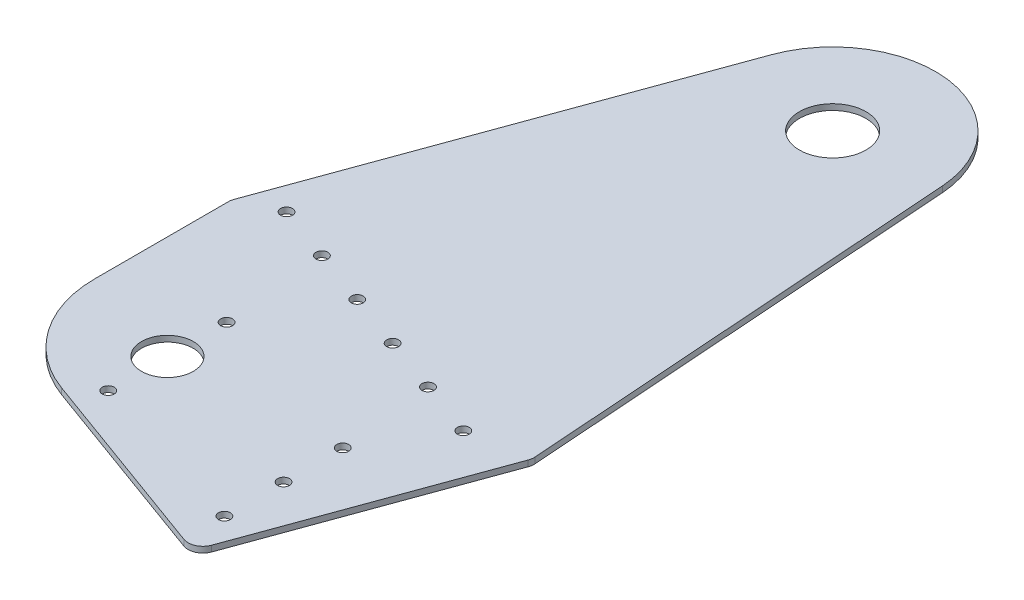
from build123d import *

# Parameters (mm, degrees)
SKETCH1_R                  = 14.2875
SKETCH1_R_2                = 11.1125
SKETCH1_R_3                = 2.5527
BOSS_EXTRUDE1_DEPTH        = 2.54
F_7_0_201_DIAMETER_HOLE1_D = 5.1054
CUT_EXTRUDE2_DEPTH         = 0.127


with BuildPart() as part:
    # Sketch1 → Boss-Extrude1 (new body)
    with BuildSketch(Plane(origin=(0, 0, 0), x_dir=(1, 0, 0), z_dir=(0, 1, 0))):
        with BuildLine():
            Line((0, 79.961539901), (0, 137.226043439))
            ThreePointArc((0, 137.226043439), (0.096470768, 138.328709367), (0.382951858, 139.397871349))
            Line((0.382951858, 139.397871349), (8.68731164, 162.213912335))
            Line((8.68731164, 162.213912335), (61.897095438, 308.406591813))
            ThreePointArc((61.897095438, 308.406591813), (109.5024689, 337.025784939), (147.412775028, 296.428513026))
            Line((147.412775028, 296.428513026), (160.751422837, 108.18172413))
            ThreePointArc((160.751422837, 108.18172413), (160.705914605, 106.852067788), (160.384352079, 105.56107804))
            Line((160.384352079, 105.56107804), (124.135089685, 5.967048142))
            ThreePointArc((124.135089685, 5.967048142), (120.851667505, 2.383821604), (115.996213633, 2.17182791))
            Line((115.996213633, 2.17182791), (33.425376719, 32.225154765))
            ThreePointArc((33.425376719, 32.225154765), (9.18707615, 50.823856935), (0, 79.961539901))
        make_face()
        with Locations(Location((103.379027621, 293.308403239, 0), (0, 0, 270))):
            Circle(SKETCH1_R, mode=Mode.SUBTRACT)
        with Locations(Location((44.45, 66.621712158, 0), (0, 0, 270))):
            Circle(SKETCH1_R_2, mode=Mode.SUBTRACT)
        with Locations(Location((44.45, 92.021712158, 0), (0, 0, 270))):
            Circle(SKETCH1_R_3, mode=Mode.SUBTRACT)
        with Locations(Location((44.45, 41.221712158, 0), (0, 0, 270))):
            Circle(SKETCH1_R_3, mode=Mode.SUBTRACT)
    extrude(amount=BOSS_EXTRUDE1_DEPTH)

    # 7 _0.201_ Diameter Hole1 (through all)
    with Locations(Plane(origin=(0, 0, 0), x_dir=(-1, 0, 0), z_dir=(0, -1, 0))):
        with Locations((-135.618714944, 102.499602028), (-111.750522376, 111.186913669), (-87.882329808, 119.874225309), (-64.01413724, 128.56153695), (-40.145944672, 137.24884859), (-16.277752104, 145.936160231), (-116.079027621, 70.264108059), (-116.079027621, 44.864108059), (-116.079027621, 19.464108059)):
            Hole(F_7_0_201_DIAMETER_HOLE1_D / 2)

    # Sketch8 → Cut-Extrude2 (cut)
    with BuildSketch(Plane.XZ):
        with BuildLine():
            Line((142.678490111, -130.340522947), (147.199116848, -128.694042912))
            Line((147.199116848, -128.694042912), (147.461274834, -128.598131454))
            add(Edge.make_bspline(
                [(147.461274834, -128.598131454), (147.518382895, -128.578494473), (147.626739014, -128.541235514), (147.787225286, -128.51166484), (147.932937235, -128.507826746), (148.064673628, -128.525858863), (148.180584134, -128.569593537), (148.277897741, -128.640688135), (148.356925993, -128.734389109), (148.388285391, -128.811211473), (148.404404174, -128.850698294)],
                knots=[0, 0, 0, 0, 1.313667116, 2.492535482, 3.536993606, 4.475555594, 5.371860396, 6.202696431, 7.07618301, 8, 8, 8, 8], degree=3))
            add(Edge.make_bspline(
                [(148.404404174, -128.850698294), (148.424169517, -128.91612278), (148.461448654, -129.039518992), (148.440013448, -129.233024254), (148.352337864, -129.407393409), (148.254428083, -129.49515453), (148.202990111, -129.541260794)],
                knots=[0, 0, 0, 0, 1.048991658, 1.978488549, 2.93797689, 4, 4, 4, 4], degree=3))
            add(Edge.make_bspline(
                [(148.202990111, -129.541260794), (148.159429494, -129.576572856), (148.082907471, -129.638604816), (147.980715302, -129.718381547), (147.913280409, -129.778909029), (147.857086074, -129.825049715), (147.818175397, -129.89109086), (147.802772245, -129.946730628), (147.793767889, -129.979256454)],
                knots=[0, 0, 0, 0, 1.645585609, 2.890765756, 3.799650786, 4.308634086, 5.011263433, 6, 6, 6, 6], degree=3))
            add(Edge.make_bspline(
                [(147.793767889, -129.979256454), (147.785886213, -130.016395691), (147.768901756, -130.096428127), (147.774931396, -130.229069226), (147.805478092, -130.379334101), (147.841403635, -130.482653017), (147.86090591, -130.53873996)],
                knots=[0, 0, 0, 0, 0.793290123, 1.709484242, 2.756587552, 4, 4, 4, 4], degree=3))
            Line((147.86090591, -130.53873996), (151.531117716, -140.62223128))
            add(Edge.make_bspline(
                [(151.531117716, -140.62223128), (151.552552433, -140.674879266), (151.592342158, -140.772610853), (151.661839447, -140.903444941), (151.740998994, -141.006154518), (151.804985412, -141.053925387), (151.834837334, -141.076212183)],
                knots=[0, 0, 0, 0, 1.228251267, 2.280029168, 3.197572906, 4, 4, 4, 4], degree=3))
            add(Edge.make_bspline(
                [(151.834837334, -141.076212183), (151.861350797, -141.096403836), (151.907327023, -141.131417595), (151.980932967, -141.152552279), (152.052283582, -141.148502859), (152.142814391, -141.150860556), (152.27181157, -141.146168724), (152.370884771, -141.142310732), (152.426291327, -141.140153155)],
                knots=[0, 0, 0, 0, 0.97626264, 1.692908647, 2.195740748, 3.075696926, 4.364587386, 6, 6, 6, 6], degree=3))
            add(Edge.make_bspline(
                [(152.426291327, -141.140153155), (152.495265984, -141.140747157), (152.624906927, -141.14186361), (152.801921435, -141.216609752), (152.939953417, -141.347195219), (152.990802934, -141.462634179), (153.01774532, -141.523798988)],
                knots=[0, 0, 0, 0, 1.07887602, 2.02779556, 2.955036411, 4, 4, 4, 4], degree=3))
            add(Edge.make_bspline(
                [(153.01774532, -141.523798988), (153.028856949, -141.562842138), (153.050477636, -141.638811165), (153.056909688, -141.757617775), (153.019893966, -141.869546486), (152.962045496, -141.97703868), (152.874336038, -142.077424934), (152.754991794, -142.162088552), (152.614338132, -142.243321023), (152.507963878, -142.285063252), (152.451867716, -142.307075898)],
                knots=[0, 0, 0, 0, 0.895180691, 1.741816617, 2.574963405, 3.458649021, 4.425078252, 5.482965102, 6.672648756, 8, 8, 8, 8], degree=3))
            Line((152.451867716, -142.307075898), (152.18970973, -142.402987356))
            Line((152.18970973, -142.402987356), (147.669082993, -144.049467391))
            Line((147.669082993, -144.049467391), (147.406925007, -144.142181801))
            add(Edge.make_bspline(
                [(147.406925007, -144.142181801), (147.349745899, -144.16153136), (147.241066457, -144.198308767), (147.081237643, -144.231525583), (146.935409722, -144.239460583), (146.804132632, -144.221543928), (146.691343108, -144.175651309), (146.593380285, -144.110754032), (146.519008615, -144.01831589), (146.486720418, -143.94588159), (146.470189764, -143.908797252)],
                knots=[0, 0, 0, 0, 1.331017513, 2.529844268, 3.588880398, 4.539838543, 5.426110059, 6.254348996, 7.106275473, 8, 8, 8, 8], degree=3))
            add(Edge.make_bspline(
                [(146.470189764, -143.908797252), (146.451784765, -143.844376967), (146.417053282, -143.722811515), (146.437696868, -143.532807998), (146.525851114, -143.360482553), (146.625344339, -143.27582515), (146.677997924, -143.231022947)],
                knots=[0, 0, 0, 0, 1.042573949, 1.967407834, 2.924316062, 4, 4, 4, 4], degree=3))
            add(Edge.make_bspline(
                [(146.677997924, -143.231022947), (146.721974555, -143.197282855), (146.799624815, -143.137707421), (146.897327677, -143.055687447), (146.969571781, -143.002977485), (147.023622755, -142.955860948), (147.067010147, -142.892160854), (147.081836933, -142.835441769), (147.090417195, -142.802618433)],
                knots=[0, 0, 0, 0, 1.637578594, 2.891499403, 3.766902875, 4.279459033, 5.004322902, 6, 6, 6, 6], degree=3))
            add(Edge.make_bspline(
                [(147.090417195, -142.802618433), (147.09837975, -142.766541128), (147.115339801, -142.689697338), (147.108225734, -142.561652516), (147.082888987, -142.416320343), (147.048312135, -142.316256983), (147.029673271, -142.262317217)],
                knots=[0, 0, 0, 0, 0.799685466, 1.703310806, 2.761955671, 4, 4, 4, 4], degree=3))
            Line((147.029673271, -142.262317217), (143.359461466, -132.178825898))
            add(Edge.make_bspline(
                [(143.359461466, -132.178825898), (143.325423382, -132.095015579), (143.264017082, -131.943817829), (143.136177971, -131.759986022), (142.983761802, -131.638048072), (142.867743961, -131.625356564), (142.812766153, -131.619342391)],
                knots=[0, 0, 0, 0, 1.300292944, 2.345789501, 3.21611309, 4, 4, 4, 4], degree=3))
            Line((142.812766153, -131.619342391), (142.45149966, -131.635327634))
            add(Edge.make_bspline(
                [(142.45149966, -131.635327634), (142.383505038, -131.63490184), (142.2543355, -131.634092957), (142.077237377, -131.554495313), (141.937893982, -131.418414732), (141.884899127, -131.298936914), (141.856848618, -131.235696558)],
                knots=[0, 0, 0, 0, 1.045675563, 1.986472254, 2.934227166, 4, 4, 4, 4], degree=3))
            add(Edge.make_bspline(
                [(141.856848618, -131.235696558), (141.844587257, -131.193425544), (141.82100975, -131.112142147), (141.812614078, -130.988308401), (141.838612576, -130.871193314), (141.900676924, -130.767376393), (141.98594369, -130.668355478), (142.103112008, -130.580032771), (142.24921399, -130.500326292), (142.358245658, -130.456555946), (142.416332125, -130.433237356)],
                knots=[0, 0, 0, 0, 0.949533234, 1.825867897, 2.652690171, 3.498223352, 4.412470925, 5.462780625, 6.648299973, 8, 8, 8, 8], degree=3))
            Line((142.416332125, -130.433237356), (142.678490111, -130.340522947))
        make_face()
        with BuildLine():
            Line((142.256479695, -141.610119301), (136.354727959, -134.694903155))
            add(Edge.make_bspline(
                [(136.354727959, -134.694903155), (136.282693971, -134.611341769), (136.154587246, -134.462734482), (135.944269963, -134.291333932), (135.729421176, -134.182086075), (135.578011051, -134.165979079), (135.50111598, -134.157798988)],
                knots=[0, 0, 0, 0, 1.269579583, 2.257846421, 3.115230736, 4, 4, 4, 4], degree=3))
            add(Edge.make_bspline(
                [(135.50111598, -134.157798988), (135.433623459, -134.150079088), (135.324715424, -134.137622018), (135.218576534, -134.110547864), (135.17821407, -134.100252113)],
                knots=[0, 0, 0, 0, 1.239440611, 2, 2, 2, 2], degree=3))
            add(Edge.make_bspline(
                [(135.17821407, -134.100252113), (135.118952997, -134.062962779), (134.993975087, -133.984321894), (134.93452722, -133.848676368), (134.903267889, -133.777350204)],
                knots=[0, 0, 0, 0, 0.948344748, 2, 2, 2, 2], degree=3))
            add(Edge.make_bspline(
                [(134.903267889, -133.777350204), (134.889926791, -133.734041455), (134.864919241, -133.652860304), (134.853427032, -133.529592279), (134.87248326, -133.414585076), (134.922904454, -133.309868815), (134.99867301, -133.215286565), (135.101835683, -133.131494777), (135.229261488, -133.054377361), (135.327725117, -133.016982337), (135.379628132, -132.997270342)],
                knots=[0, 0, 0, 0, 1.03998122, 1.949418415, 2.819391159, 3.685214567, 4.592008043, 5.583233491, 6.726052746, 8, 8, 8, 8], degree=3))
            Line((135.379628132, -132.997270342), (140.456541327, -131.149376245))
            add(Edge.make_bspline(
                [(140.456541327, -131.149376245), (140.517863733, -131.128354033), (140.633470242, -131.088722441), (140.804929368, -131.060315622), (140.960607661, -131.054069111), (141.101258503, -131.079977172), (141.22416636, -131.131663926), (141.331703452, -131.206013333), (141.413122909, -131.313247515), (141.448404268, -131.396749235), (141.466808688, -131.440307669)],
                knots=[0, 0, 0, 0, 1.306819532, 2.463648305, 3.496779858, 4.437970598, 5.325217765, 6.173237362, 7.047074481, 8, 8, 8, 8], degree=3))
            add(Edge.make_bspline(
                [(141.466808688, -131.440307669), (141.481627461, -131.493256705), (141.511449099, -131.599812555), (141.479404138, -131.770707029), (141.394878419, -131.93753168), (141.304641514, -132.031861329), (141.25580348, -132.08291444)],
                knots=[0, 0, 0, 0, 0.90866313, 1.828614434, 2.82480229, 4, 4, 4, 4], degree=3))
            add(Edge.make_bspline(
                [(141.25580348, -132.08291444), (141.199856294, -132.141828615), (141.106715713, -132.239908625), (140.992611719, -132.37422139), (140.951451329, -132.508864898), (140.966543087, -132.59014908), (140.974463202, -132.632806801)],
                knots=[0, 0, 0, 0, 1.499726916, 2.496737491, 3.211091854, 4, 4, 4, 4], degree=3))
            add(Edge.make_bspline(
                [(140.974463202, -132.632806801), (140.981511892, -132.647967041), (140.998927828, -132.685425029), (141.04464333, -132.745994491), (141.102804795, -132.828811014), (141.151918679, -132.887880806), (141.179074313, -132.920541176)],
                knots=[0, 0, 0, 0, 0.565575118, 1.397425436, 2.561006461, 4, 4, 4, 4], degree=3))
            Line((141.179074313, -132.920541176), (143.931733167, -136.261456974))
            add(Edge.make_bspline(
                [(143.931733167, -136.261456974), (143.992822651, -136.336086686), (144.108436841, -136.477326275), (144.251477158, -136.694267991), (144.371460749, -136.89472262), (144.426678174, -137.031196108), (144.452852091, -137.095886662)],
                knots=[0, 0, 0, 0, 1.170241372, 2.214726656, 3.153752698, 4, 4, 4, 4], degree=3))
            add(Edge.make_bspline(
                [(144.452852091, -137.095886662), (144.470321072, -137.157264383), (144.507133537, -137.286605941), (144.511623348, -137.499537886), (144.486749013, -137.733355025), (144.44159093, -137.891404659), (144.417684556, -137.97507503)],
                knots=[0, 0, 0, 0, 0.853375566, 1.798322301, 2.834447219, 4, 4, 4, 4], degree=3))
            Line((144.417684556, -137.97507503), (143.058938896, -142.300681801))
            add(Edge.make_bspline(
                [(143.058938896, -142.300681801), (143.031537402, -142.399180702), (142.978550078, -142.589651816), (142.948416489, -142.878860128), (142.968539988, -143.158224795), (143.022557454, -143.332978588), (143.04934775, -143.419648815)],
                knots=[0, 0, 0, 0, 1.075096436, 2.078955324, 3.047245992, 4, 4, 4, 4], degree=3))
            add(Edge.make_bspline(
                [(143.04934775, -143.419648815), (143.068185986, -143.465099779), (143.105612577, -143.555398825), (143.187323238, -143.679356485), (143.291158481, -143.786850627), (143.408657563, -143.884136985), (143.542965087, -143.960380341), (143.68665906, -144.014014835), (143.837408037, -144.048354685), (143.94006954, -144.051207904), (143.992477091, -144.05266444)],
                knots=[0, 0, 0, 0, 0.974189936, 1.935457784, 2.922174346, 3.928831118, 4.95111638, 5.967706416, 6.962536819, 8, 8, 8, 8], degree=3))
            Line((143.992477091, -144.05266444), (144.459246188, -144.055861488))
            add(Edge.make_bspline(
                [(144.459246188, -144.055861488), (144.527177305, -144.058037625), (144.652913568, -144.062065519), (144.820367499, -144.129539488), (144.953593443, -144.235166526), (144.998880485, -144.334571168), (145.021926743, -144.385157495)],
                knots=[0, 0, 0, 0, 1.159630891, 2.146404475, 3.056718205, 4, 4, 4, 4], degree=3))
            add(Edge.make_bspline(
                [(145.021926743, -144.385157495), (145.034508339, -144.429550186), (145.059041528, -144.516112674), (145.062911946, -144.652335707), (145.03046591, -144.785865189), (144.984566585, -144.865636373), (144.96118282, -144.906276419)],
                knots=[0, 0, 0, 0, 1.014563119, 1.978323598, 2.970041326, 4, 4, 4, 4], degree=3))
            add(Edge.make_bspline(
                [(144.96118282, -144.906276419), (144.939963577, -144.934080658), (144.89417647, -144.994076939), (144.792784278, -145.065653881), (144.66823334, -145.13691318), (144.571803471, -145.174054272), (144.519990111, -145.194010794)],
                knots=[0, 0, 0, 0, 0.780956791, 1.685156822, 2.756196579, 4, 4, 4, 4], degree=3))
            Line((144.519990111, -145.194010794), (140.926507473, -146.501603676))
            add(Edge.make_bspline(
                [(140.926507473, -146.501603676), (140.865194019, -146.522641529), (140.748608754, -146.562644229), (140.574875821, -146.590956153), (140.415217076, -146.595880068), (140.270895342, -146.574222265), (140.141451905, -146.527812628), (140.037751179, -146.446745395), (139.95003204, -146.345976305), (139.915121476, -146.263130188), (139.89705782, -146.220263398)],
                knots=[0, 0, 0, 0, 1.293300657, 2.459163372, 3.502899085, 4.472757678, 5.362626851, 6.214478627, 7.076123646, 8, 8, 8, 8], degree=3))
            add(Edge.make_bspline(
                [(139.89705782, -146.220263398), (139.877590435, -146.152521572), (139.839696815, -146.020660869), (139.879017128, -145.812617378), (139.98362033, -145.618194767), (140.095760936, -145.514880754), (140.156018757, -145.459365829)],
                knots=[0, 0, 0, 0, 0.970145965, 1.888406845, 2.865352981, 4, 4, 4, 4], degree=3))
            Line((140.156018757, -145.459365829), (140.625984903, -145.050143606))
            add(Edge.make_bspline(
                [(140.625984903, -145.050143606), (140.67826941, -145.003294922), (140.792526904, -144.900916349), (140.952895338, -144.707514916), (141.129755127, -144.475876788), (141.241228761, -144.299827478), (141.30056216, -144.206122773)],
                knots=[0, 0, 0, 0, 0.775904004, 1.695585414, 2.773443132, 4, 4, 4, 4], degree=3))
            add(Edge.make_bspline(
                [(141.30056216, -144.206122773), (141.348908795, -144.120536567), (141.455248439, -143.932287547), (141.594059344, -143.608223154), (141.742333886, -143.225442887), (141.835653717, -142.947986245), (141.885622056, -142.799421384)],
                knots=[0, 0, 0, 0, 0.77236567, 1.698837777, 2.767836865, 4, 4, 4, 4], degree=3))
            Line((141.885622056, -142.799421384), (142.256479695, -141.610119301))
        make_face()
        with BuildLine():
            Line((127.693648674, -135.792302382), (132.214275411, -134.149019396))
            Line((132.214275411, -134.149019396), (132.476433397, -134.053107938))
            add(Edge.make_bspline(
                [(132.476433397, -134.053107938), (132.533541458, -134.033470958), (132.641897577, -133.996211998), (132.802383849, -133.966641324), (132.948095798, -133.96280323), (133.079832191, -133.980835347), (133.195742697, -134.024570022), (133.293056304, -134.095664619), (133.372084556, -134.189365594), (133.403443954, -134.266187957), (133.419562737, -134.305674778)],
                knots=[0, 0, 0, 0, 1.313667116, 2.492535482, 3.536993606, 4.475555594, 5.371860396, 6.202696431, 7.07618301, 8, 8, 8, 8], degree=3))
            add(Edge.make_bspline(
                [(133.419562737, -134.305674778), (133.43932808, -134.371099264), (133.476607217, -134.494495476), (133.455172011, -134.688000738), (133.367496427, -134.862369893), (133.269586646, -134.950131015), (133.218148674, -134.996237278)],
                knots=[0, 0, 0, 0, 1.048991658, 1.978488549, 2.93797689, 4, 4, 4, 4], degree=3))
            add(Edge.make_bspline(
                [(133.218148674, -134.996237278), (133.17446615, -135.031404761), (133.097729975, -135.093182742), (132.997274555, -135.173954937), (132.927609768, -135.230779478), (132.87234621, -135.276934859), (132.832655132, -135.343680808), (132.817747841, -135.400569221), (132.808926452, -135.434232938)],
                knots=[0, 0, 0, 0, 1.642959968, 2.886153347, 3.773498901, 4.281670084, 4.98317834, 6, 6, 6, 6], degree=3))
            add(Edge.make_bspline(
                [(132.808926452, -135.434232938), (132.801044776, -135.471372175), (132.784060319, -135.551404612), (132.790089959, -135.684045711), (132.820636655, -135.834310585), (132.856562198, -135.937629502), (132.876064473, -135.993716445)],
                knots=[0, 0, 0, 0, 0.793290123, 1.709484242, 2.756587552, 4, 4, 4, 4], degree=3))
            Line((132.876064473, -135.993716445), (136.546276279, -146.077207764))
            add(Edge.make_bspline(
                [(136.546276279, -146.077207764), (136.567710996, -146.129855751), (136.607500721, -146.227587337), (136.67699801, -146.358421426), (136.756157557, -146.461131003), (136.820143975, -146.508901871), (136.849995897, -146.531188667)],
                knots=[0, 0, 0, 0, 1.228251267, 2.280029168, 3.197572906, 4, 4, 4, 4], degree=3))
            add(Edge.make_bspline(
                [(136.849995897, -146.531188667), (136.876842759, -146.54950276), (136.923992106, -146.581666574), (136.995554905, -146.608252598), (137.067540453, -146.603182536), (137.157924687, -146.605982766), (137.286988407, -146.601090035), (137.386049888, -146.597267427), (137.44144989, -146.595129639)],
                knots=[0, 0, 0, 0, 0.960695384, 1.687204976, 2.190702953, 3.071824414, 4.362421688, 6, 6, 6, 6], degree=3))
            add(Edge.make_bspline(
                [(137.44144989, -146.595129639), (137.510424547, -146.595723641), (137.64006549, -146.596840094), (137.817079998, -146.671586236), (137.95511198, -146.802171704), (138.005961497, -146.917610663), (138.032903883, -146.978775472)],
                knots=[0, 0, 0, 0, 1.07887602, 2.02779556, 2.955036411, 4, 4, 4, 4], degree=3))
            add(Edge.make_bspline(
                [(138.032903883, -146.978775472), (138.044015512, -147.017818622), (138.065636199, -147.093787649), (138.072068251, -147.212594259), (138.035052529, -147.32452297), (137.977204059, -147.432015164), (137.889494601, -147.532401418), (137.770150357, -147.617065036), (137.629496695, -147.698297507), (137.523122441, -147.740039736), (137.467026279, -147.762052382)],
                knots=[0, 0, 0, 0, 0.895180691, 1.741816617, 2.574963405, 3.458649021, 4.425078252, 5.482965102, 6.672648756, 8, 8, 8, 8], degree=3))
            Line((137.467026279, -147.762052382), (137.204868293, -147.857963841))
            Line((137.204868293, -147.857963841), (132.684241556, -149.501246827))
            Line((132.684241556, -149.501246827), (132.42208357, -149.597158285))
            add(Edge.make_bspline(
                [(132.42208357, -149.597158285), (132.364979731, -149.616936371), (132.256631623, -149.654463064), (132.096056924, -149.682257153), (131.950479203, -149.69179075), (131.82008351, -149.672245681), (131.705808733, -149.631387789), (131.608638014, -149.565469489), (131.534140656, -149.473362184), (131.501870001, -149.400881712), (131.485348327, -149.363773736)],
                knots=[0, 0, 0, 0, 1.333158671, 2.529518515, 3.590258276, 4.542746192, 5.421969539, 6.251540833, 7.104837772, 8, 8, 8, 8], degree=3))
            add(Edge.make_bspline(
                [(131.485348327, -149.363773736), (131.466943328, -149.299353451), (131.432211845, -149.177787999), (131.452855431, -148.987784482), (131.541009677, -148.815459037), (131.640502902, -148.730801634), (131.693156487, -148.685999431)],
                knots=[0, 0, 0, 0, 1.042573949, 1.967407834, 2.924316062, 4, 4, 4, 4], degree=3))
            add(Edge.make_bspline(
                [(131.693156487, -148.685999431), (131.736945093, -148.65203029), (131.814263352, -148.592050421), (131.9143428, -148.511879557), (131.982388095, -148.454117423), (132.040099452, -148.411298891), (132.081788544, -148.34670014), (132.09685614, -148.29025799), (132.105575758, -148.257594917)],
                knots=[0, 0, 0, 0, 1.637886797, 2.892043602, 3.787214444, 4.279135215, 5.004135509, 6, 6, 6, 6], degree=3))
            add(Edge.make_bspline(
                [(132.105575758, -148.257594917), (132.113509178, -148.221516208), (132.130636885, -148.143624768), (132.123544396, -148.014486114), (132.098054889, -147.868098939), (132.063473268, -147.768036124), (132.044831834, -147.714096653)],
                knots=[0, 0, 0, 0, 0.79508296, 1.716529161, 2.769081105, 4, 4, 4, 4], degree=3))
            Line((132.044831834, -147.714096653), (128.374620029, -137.630605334))
            add(Edge.make_bspline(
                [(128.374620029, -137.630605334), (128.353997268, -137.575395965), (128.315610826, -137.472631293), (128.23656088, -137.341686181), (128.158718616, -137.234026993), (128.094463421, -137.183974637), (128.064506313, -137.160639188)],
                knots=[0, 0, 0, 0, 1.234302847, 2.297485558, 3.206252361, 4, 4, 4, 4], degree=3))
            add(Edge.make_bspline(
                [(128.064506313, -137.160639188), (128.037869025, -137.140638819), (127.990616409, -137.105159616), (127.916571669, -137.082316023), (127.843909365, -137.080119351), (127.753322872, -137.080396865), (127.624387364, -137.084611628), (127.525271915, -137.086212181), (127.469855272, -137.08710707)],
                knots=[0, 0, 0, 0, 0.969960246, 1.720639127, 2.221199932, 3.095475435, 4.37604529, 6, 6, 6, 6], degree=3))
            add(Edge.make_bspline(
                [(127.469855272, -137.08710707), (127.400816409, -137.085321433), (127.269725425, -137.081930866), (127.09108084, -137.004012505), (126.949572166, -136.871302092), (126.898778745, -136.753017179), (126.872007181, -136.690673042)],
                knots=[0, 0, 0, 0, 1.06378334, 2.019911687, 2.956359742, 4, 4, 4, 4], degree=3))
            add(Edge.make_bspline(
                [(126.872007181, -136.690673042), (126.858888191, -136.64949916), (126.833712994, -136.570486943), (126.836705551, -136.447432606), (126.859646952, -136.329641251), (126.922118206, -136.221494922), (127.009691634, -136.121192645), (127.127271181, -136.03273052), (127.269178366, -135.952204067), (127.375449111, -135.910307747), (127.431490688, -135.888213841)],
                knots=[0, 0, 0, 0, 0.932211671, 1.788903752, 2.642775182, 3.513125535, 4.464970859, 5.520948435, 6.692679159, 8, 8, 8, 8], degree=3))
            Line((127.431490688, -135.888213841), (127.693648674, -135.792302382))
        make_face()
        with BuildLine():
            Line((122.380044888, -153.252150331), (118.089605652, -141.46782915))
            add(Edge.make_bspline(
                [(118.089605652, -141.46782915), (118.065670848, -141.406282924), (118.021623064, -141.29301795), (117.936644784, -141.145927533), (117.847319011, -141.029245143), (117.772356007, -140.979257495), (117.737930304, -140.956301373)],
                knots=[0, 0, 0, 0, 1.250237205, 2.300841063, 3.21968522, 4, 4, 4, 4], degree=3))
            add(Edge.make_bspline(
                [(117.737930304, -140.956301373), (117.702648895, -140.936253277), (117.640789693, -140.901102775), (117.549987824, -140.878815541), (117.465074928, -140.887981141), (117.361618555, -140.892078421), (117.215788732, -140.90703637), (117.103861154, -140.916062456), (117.040973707, -140.921133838)],
                knots=[0, 0, 0, 0, 1.022213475, 1.792255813, 2.303892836, 3.166085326, 4.407741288, 6, 6, 6, 6], degree=3))
            add(Edge.make_bspline(
                [(117.040973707, -140.921133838), (116.961668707, -140.926618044), (116.81458413, -140.936789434), (116.60800719, -140.869491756), (116.444727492, -140.733198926), (116.38914151, -140.604798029), (116.360002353, -140.537488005)],
                knots=[0, 0, 0, 0, 1.108769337, 2.056400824, 2.98113088, 4, 4, 4, 4], degree=3))
            add(Edge.make_bspline(
                [(116.360002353, -140.537488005), (116.347969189, -140.494162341), (116.324168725, -140.408468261), (116.331509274, -140.272520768), (116.379693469, -140.13837988), (116.435635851, -140.058838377), (116.465504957, -140.016369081)],
                knots=[0, 0, 0, 0, 0.965229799, 1.909133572, 2.883631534, 4, 4, 4, 4], degree=3))
            add(Edge.make_bspline(
                [(116.465504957, -140.016369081), (116.494196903, -139.984181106), (116.557641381, -139.913006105), (116.690677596, -139.826241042), (116.85774028, -139.739762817), (116.984938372, -139.691050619), (117.053761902, -139.664693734)],
                knots=[0, 0, 0, 0, 0.743719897, 1.644535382, 2.725520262, 4, 4, 4, 4], degree=3))
            Line((117.053761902, -139.664693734), (117.37986086, -139.546402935))
            Line((117.37986086, -139.546402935), (121.900487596, -137.903119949))
            Line((121.900487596, -137.903119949), (122.229783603, -137.781632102))
            add(Edge.make_bspline(
                [(122.229783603, -137.781632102), (122.298562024, -137.757503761), (122.427962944, -137.712108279), (122.61825042, -137.674192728), (122.78832568, -137.657897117), (122.939092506, -137.67405895), (123.069542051, -137.713523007), (123.177773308, -137.784656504), (123.263456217, -137.883055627), (123.298608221, -137.963723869), (123.316780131, -138.005425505)],
                knots=[0, 0, 0, 0, 1.399553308, 2.633143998, 3.722140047, 4.670177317, 5.531926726, 6.316143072, 7.129526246, 8, 8, 8, 8], degree=3))
            add(Edge.make_bspline(
                [(123.316780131, -138.005425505), (123.337685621, -138.076226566), (123.377169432, -138.209947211), (123.340565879, -138.418688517), (123.226788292, -138.602940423), (123.106579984, -138.688349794), (123.04183395, -138.734352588)],
                knots=[0, 0, 0, 0, 1.027586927, 1.940784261, 2.890874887, 4, 4, 4, 4], degree=3))
            add(Edge.make_bspline(
                [(123.04183395, -138.734352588), (122.988440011, -138.77148418), (122.894264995, -138.836976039), (122.772545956, -138.924594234), (122.685990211, -138.984363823), (122.617473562, -139.034682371), (122.565508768, -139.108292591), (122.547159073, -139.173529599), (122.53670027, -139.210712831)],
                knots=[0, 0, 0, 0, 1.641171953, 2.894661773, 3.782439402, 4.298979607, 5.030466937, 6, 6, 6, 6], degree=3))
            add(Edge.make_bspline(
                [(122.53670027, -139.210712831), (122.525372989, -139.250913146), (122.5009897, -139.337449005), (122.500584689, -139.485000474), (122.531839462, -139.652626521), (122.570314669, -139.768495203), (122.591050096, -139.830940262)],
                knots=[0, 0, 0, 0, 0.786847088, 1.693779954, 2.757109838, 4, 4, 4, 4], degree=3))
            Line((122.591050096, -139.830940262), (126.881489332, -151.615261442))
            Line((126.881489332, -151.615261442), (122.380044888, -153.252150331))
        make_face()
        with BuildLine():
            Line((118.901655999, -154.518181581), (117.431013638, -150.480309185))
            add(Edge.make_bspline(
                [(117.431013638, -150.480309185), (117.415596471, -150.431701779), (117.386217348, -150.339074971), (117.368149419, -150.196947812), (117.38248591, -150.062564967), (117.417054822, -149.935010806), (117.476659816, -149.821003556), (117.560402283, -149.724626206), (117.663692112, -149.6463787), (117.744482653, -149.612228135), (117.785886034, -149.59472672)],
                knots=[0, 0, 0, 0, 1.142059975, 2.176322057, 3.184311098, 4.152438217, 5.124977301, 6.039749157, 6.995414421, 8, 8, 8, 8], degree=3))
            add(Edge.make_bspline(
                [(117.785886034, -149.59472672), (117.827049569, -149.581249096), (117.906935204, -149.555093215), (118.031382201, -149.545764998), (118.152459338, -149.561812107), (118.308382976, -149.619702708), (118.493014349, -149.750835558), (118.593042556, -149.901805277), (118.64589211, -149.981569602)],
                knots=[0, 0, 0, 0, 0.752527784, 1.460422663, 2.153796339, 2.864608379, 4.343426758, 6, 6, 6, 6], degree=3))
            Line((118.64589211, -149.981569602), (118.971991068, -150.553841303))
            add(Edge.make_bspline(
                [(118.971991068, -150.553841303), (119.05416302, -150.694445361), (119.214288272, -150.968434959), (119.501023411, -151.336266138), (119.802168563, -151.668533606), (120.029877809, -151.853427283), (120.14211086, -151.944557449)],
                knots=[0, 0, 0, 0, 1.066855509, 2.078939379, 3.053150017, 4, 4, 4, 4], degree=3))
            add(Edge.make_bspline(
                [(120.14211086, -151.944557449), (120.21439522, -151.995652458), (120.358795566, -152.097723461), (120.59998004, -152.214647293), (120.856016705, -152.311166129), (121.037629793, -152.345770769), (121.129998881, -152.363370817)],
                knots=[0, 0, 0, 0, 0.978988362, 1.955696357, 2.960259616, 4, 4, 4, 4], degree=3))
            Line((121.129998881, -152.363370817), (121.561600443, -153.549475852))
            Line((121.561600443, -153.549475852), (118.901655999, -154.518181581))
        make_face()
        with BuildLine():
            Line((130.359878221, -150.349230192), (127.699933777, -151.314738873))
            Line((127.699933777, -151.314738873), (127.268332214, -150.128633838))
            add(Edge.make_bspline(
                [(127.268332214, -150.128633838), (127.328142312, -150.055613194), (127.445853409, -149.911902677), (127.580795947, -149.672704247), (127.690697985, -149.42824598), (127.735271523, -149.257694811), (127.757480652, -149.172716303)],
                knots=[0, 0, 0, 0, 1.042765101, 2.052245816, 3.029515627, 4, 4, 4, 4], degree=3))
            add(Edge.make_bspline(
                [(127.757480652, -149.172716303), (127.784454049, -149.031416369), (127.839474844, -148.74319036), (127.856207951, -148.295557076), (127.836639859, -147.829550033), (127.784361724, -147.517332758), (127.757480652, -147.356792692)],
                knots=[0, 0, 0, 0, 0.943126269, 1.923804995, 2.932434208, 4, 4, 4, 4], degree=3))
            Line((127.757480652, -147.356792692), (127.635992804, -146.707791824))
            add(Edge.make_bspline(
                [(127.635992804, -146.707791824), (127.624896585, -146.611530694), (127.604088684, -146.431019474), (127.666928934, -146.214340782), (127.745856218, -146.068443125), (127.832442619, -145.983630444), (127.930572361, -145.908119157), (128.007967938, -145.876892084), (128.048412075, -145.860573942)],
                knots=[0, 0, 0, 0, 1.676489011, 3.143793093, 3.852413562, 4.549951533, 5.242256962, 6, 6, 6, 6], degree=3))
            add(Edge.make_bspline(
                [(128.048412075, -145.860573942), (128.091704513, -145.8467602), (128.175841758, -145.819913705), (128.30586856, -145.815294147), (128.432474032, -145.832736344), (128.549604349, -145.886865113), (128.658607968, -145.959391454), (128.754267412, -146.055883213), (128.834477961, -146.173700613), (128.870673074, -146.264692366), (128.88923586, -146.311357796)],
                knots=[0, 0, 0, 0, 1.013707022, 1.970101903, 2.888785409, 3.851420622, 4.831666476, 5.811039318, 6.877384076, 8, 8, 8, 8], degree=3))
            Line((128.88923586, -146.311357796), (130.359878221, -150.349230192))
        make_face()
        with BuildLine():
            Line((112.120776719, -156.986029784), (107.130183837, -143.277085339))
            Line((107.130183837, -143.277085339), (111.641219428, -141.636999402))
            Line((111.641219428, -141.636999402), (111.903377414, -141.541087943))
            add(Edge.make_bspline(
                [(111.903377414, -141.541087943), (111.960485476, -141.521450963), (112.068841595, -141.484192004), (112.229327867, -141.45462133), (112.375039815, -141.450783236), (112.506776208, -141.468815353), (112.622686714, -141.512550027), (112.720000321, -141.583644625), (112.799028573, -141.677345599), (112.830387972, -141.754167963), (112.846506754, -141.793654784)],
                knots=[0, 0, 0, 0, 1.313667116, 2.492535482, 3.536993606, 4.475555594, 5.371860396, 6.202696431, 7.07618301, 8, 8, 8, 8], degree=3))
            add(Edge.make_bspline(
                [(112.846506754, -141.793654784), (112.866272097, -141.85907927), (112.903551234, -141.982475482), (112.882116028, -142.175980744), (112.794440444, -142.350349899), (112.696530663, -142.43811102), (112.645092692, -142.484217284)],
                knots=[0, 0, 0, 0, 1.048991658, 1.978488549, 2.93797689, 4, 4, 4, 4], degree=3))
            add(Edge.make_bspline(
                [(112.645092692, -142.484217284), (112.601410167, -142.519384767), (112.524673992, -142.581162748), (112.424218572, -142.661934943), (112.354553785, -142.718759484), (112.299290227, -142.764914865), (112.25959915, -142.831660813), (112.244691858, -142.888549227), (112.235870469, -142.922212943)],
                knots=[0, 0, 0, 0, 1.642959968, 2.886153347, 3.773498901, 4.281670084, 4.98317834, 6, 6, 6, 6], degree=3))
            add(Edge.make_bspline(
                [(112.235870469, -142.922212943), (112.227988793, -142.959352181), (112.211004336, -143.039384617), (112.217033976, -143.172025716), (112.247580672, -143.322290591), (112.283506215, -143.425609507), (112.30300849, -143.48169645)],
                knots=[0, 0, 0, 0, 0.793290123, 1.709484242, 2.756587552, 4, 4, 4, 4], degree=3))
            Line((112.30300849, -143.48169645), (115.973220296, -153.56518777))
            add(Edge.make_bspline(
                [(115.973220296, -153.56518777), (115.994655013, -153.617835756), (116.034444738, -153.715567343), (116.103942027, -153.846401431), (116.183101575, -153.949111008), (116.247087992, -153.996881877), (116.276939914, -154.019168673)],
                knots=[0, 0, 0, 0, 1.228251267, 2.280029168, 3.197572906, 4, 4, 4, 4], degree=3))
            add(Edge.make_bspline(
                [(116.276939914, -154.019168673), (116.303786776, -154.037482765), (116.350936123, -154.06964658), (116.422498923, -154.096232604), (116.49448447, -154.091162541), (116.584868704, -154.093962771), (116.713932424, -154.089070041), (116.812993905, -154.085247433), (116.868393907, -154.083109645)],
                knots=[0, 0, 0, 0, 0.960695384, 1.687204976, 2.190702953, 3.071824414, 4.362421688, 6, 6, 6, 6], degree=3))
            add(Edge.make_bspline(
                [(116.868393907, -154.083109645), (116.937368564, -154.083703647), (117.067009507, -154.0848201), (117.244024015, -154.159566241), (117.382055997, -154.290151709), (117.432905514, -154.405590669), (117.4598479, -154.466755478)],
                knots=[0, 0, 0, 0, 1.07887602, 2.02779556, 2.955036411, 4, 4, 4, 4], degree=3))
            add(Edge.make_bspline(
                [(117.4598479, -154.466755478), (117.47095953, -154.505798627), (117.492580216, -154.581767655), (117.499012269, -154.700574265), (117.461996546, -154.812502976), (117.404148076, -154.91999517), (117.316438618, -155.020381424), (117.197094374, -155.105045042), (117.056440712, -155.186277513), (116.950066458, -155.228019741), (116.893970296, -155.250032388)],
                knots=[0, 0, 0, 0, 0.895180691, 1.741816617, 2.574963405, 3.458649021, 4.425078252, 5.482965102, 6.672648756, 8, 8, 8, 8], degree=3))
            Line((116.893970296, -155.250032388), (116.63181231, -155.345943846))
            Line((116.63181231, -155.345943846), (112.120776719, -156.986029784))
        make_face()
        with BuildLine():
            add(Edge.make_bspline(
                [(106.736946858, -151.528667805), (106.580368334, -151.551597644), (106.285676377, -151.594753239), (105.869163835, -151.647334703), (105.506567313, -151.680295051), (105.100234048, -151.697882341), (104.640099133, -151.684003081), (104.28959249, -151.618282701), (104.118564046, -151.58621468)],
                knots=[0, 0, 0, 0, 1.080962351, 2.034448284, 2.867506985, 3.56695295, 4.812803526, 6, 6, 6, 6], degree=3))
            add(Edge.make_bspline(
                [(104.118564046, -151.58621468), (103.980935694, -151.551664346), (103.707939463, -151.483131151), (103.321730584, -151.313530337), (102.964276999, -151.09430098), (102.636749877, -150.827236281), (102.343484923, -150.516909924), (102.085629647, -150.168360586), (101.865260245, -149.782270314), (101.754733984, -149.503274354), (101.698398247, -149.361068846)],
                knots=[0, 0, 0, 0, 0.989670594, 1.96308637, 2.931967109, 3.910746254, 4.905803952, 5.906164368, 6.932762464, 8, 8, 8, 8], degree=3))
            add(Edge.make_bspline(
                [(101.698398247, -149.361068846), (101.650305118, -149.219203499), (101.556472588, -148.942415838), (101.474373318, -148.519092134), (101.438076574, -148.10643672), (101.449634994, -147.701432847), (101.514712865, -147.306267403), (101.628110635, -146.920263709), (101.787157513, -146.541627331), (101.931759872, -146.306169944), (102.005314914, -146.186399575)],
                knots=[0, 0, 0, 0, 1.083241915, 2.113468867, 3.112168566, 4.076895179, 5.038161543, 6.002394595, 6.983875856, 8, 8, 8, 8], degree=3))
            add(Edge.make_bspline(
                [(102.005314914, -146.186399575), (102.088184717, -146.065247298), (102.253408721, -145.823696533), (102.54344784, -145.494013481), (102.86427757, -145.195994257), (103.222401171, -144.923055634), (103.634340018, -144.672142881), (104.108533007, -144.426414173), (104.654731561, -144.188264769), (105.045044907, -144.039495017), (105.250319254, -143.961253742)],
                knots=[0, 0, 0, 0, 0.87740918, 1.749359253, 2.619910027, 3.493280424, 4.437955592, 5.501477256, 6.685972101, 8, 8, 8, 8], degree=3))
            Line((105.250319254, -143.961253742), (106.465197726, -143.520061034))
            Line((106.465197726, -143.520061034), (106.852040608, -144.581481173))
            add(Edge.make_bspline(
                [(106.852040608, -144.581481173), (106.735360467, -144.637102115), (106.527348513, -144.736260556), (106.261800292, -144.912042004), (106.066539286, -145.118433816), (105.989916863, -145.281047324), (105.9504729, -145.364758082)],
                knots=[0, 0, 0, 0, 1.263091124, 2.251780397, 3.100045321, 4, 4, 4, 4], degree=3))
            add(Edge.make_bspline(
                [(105.9504729, -145.364758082), (105.924073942, -145.45248385), (105.86836775, -145.637599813), (105.86516254, -145.948175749), (105.922947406, -146.290325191), (105.999337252, -146.522967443), (106.039990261, -146.646774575)],
                knots=[0, 0, 0, 0, 0.834986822, 1.761961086, 2.808964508, 4, 4, 4, 4], degree=3))
            Line((106.039990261, -146.646774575), (106.880814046, -148.955043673))
            add(Edge.make_bspline(
                [(106.880814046, -148.955043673), (106.911220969, -149.034090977), (106.968353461, -149.182615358), (107.056742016, -149.39017702), (107.149557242, -149.564359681), (107.266468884, -149.75886388), (107.450249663, -149.960905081), (107.632137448, -150.071829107), (107.724834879, -150.128360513)],
                knots=[0, 0, 0, 0, 1.028417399, 1.932324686, 2.736859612, 3.422647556, 4.686476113, 6, 6, 6, 6], degree=3))
            add(Edge.make_bspline(
                [(107.724834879, -150.128360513), (107.795823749, -150.165247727), (107.931642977, -150.23582207), (108.166693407, -150.279546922), (108.431309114, -150.261830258), (108.61933063, -150.227611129), (108.725511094, -150.208286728)],
                knots=[0, 0, 0, 0, 0.927459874, 1.774459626, 2.743181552, 4, 4, 4, 4], degree=3))
            Line((108.725511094, -150.208286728), (109.109156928, -151.26331277))
            add(Edge.make_bspline(
                [(109.109156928, -151.26331277), (109.013064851, -151.311091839), (108.842277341, -151.3960111), (108.622920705, -151.54336285), (108.462761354, -151.713626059), (108.395340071, -151.845326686), (108.361047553, -151.912313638)],
                knots=[0, 0, 0, 0, 1.269389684, 2.256126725, 3.113012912, 4, 4, 4, 4], degree=3))
            add(Edge.make_bspline(
                [(108.361047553, -151.912313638), (108.334616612, -151.987287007), (108.278811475, -152.145582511), (108.25474343, -152.399597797), (108.254409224, -152.651454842), (108.292196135, -152.80997072), (108.309894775, -152.884216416)],
                knots=[0, 0, 0, 0, 0.96112015, 2.029267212, 3.076947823, 4, 4, 4, 4], degree=3))
            Line((108.309894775, -152.884216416), (108.511308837, -153.440502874))
            Line((108.511308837, -153.440502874), (109.112353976, -155.086982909))
            add(Edge.make_bspline(
                [(109.112353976, -155.086982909), (109.15145833, -155.177793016), (109.232727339, -155.366520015), (109.401230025, -155.622719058), (109.589073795, -155.84732338), (109.73598783, -155.959724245), (109.802916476, -156.010929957)],
                knots=[0, 0, 0, 0, 1.013245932, 2.105788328, 3.137066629, 4, 4, 4, 4], degree=3))
            add(Edge.make_bspline(
                [(109.802916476, -156.010929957), (109.893778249, -156.059104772), (110.067846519, -156.151395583), (110.365794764, -156.217192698), (110.696637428, -156.199428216), (110.925814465, -156.14810427), (111.052962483, -156.11962961)],
                knots=[0, 0, 0, 0, 0.951114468, 1.822095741, 2.79169303, 4, 4, 4, 4], degree=3))
            Line((111.052962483, -156.11962961), (111.455790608, -157.229005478))
            Line((111.455790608, -157.229005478), (110.276079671, -157.657409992))
            add(Edge.make_bspline(
                [(110.276079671, -157.657409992), (110.087230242, -157.7240603), (109.720350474, -157.853542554), (109.172182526, -157.997432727), (108.650222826, -158.11110737), (108.149502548, -158.173130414), (107.672784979, -158.202708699), (107.220034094, -158.182430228), (106.790560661, -158.125074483), (106.518877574, -158.049464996), (106.385271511, -158.012282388)],
                knots=[0, 0, 0, 0, 1.208562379, 2.347886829, 3.419198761, 4.431115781, 5.391160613, 6.299173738, 7.163581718, 8, 8, 8, 8], degree=3))
            add(Edge.make_bspline(
                [(106.385271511, -158.012282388), (106.267696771, -157.972997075), (106.035985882, -157.895575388), (105.716155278, -157.722655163), (105.413980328, -157.529635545), (105.143657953, -157.295429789), (104.903365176, -157.030976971), (104.689627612, -156.742754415), (104.513563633, -156.424626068), (104.423122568, -156.198478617), (104.377524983, -156.084462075)],
                knots=[0, 0, 0, 0, 1.028382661, 2.026689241, 3.011785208, 4.004180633, 4.988440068, 5.976954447, 6.98004308, 8, 8, 8, 8], degree=3))
            add(Edge.make_bspline(
                [(104.377524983, -156.084462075), (104.339966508, -155.967914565), (104.265783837, -155.737718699), (104.19672655, -155.381785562), (104.176932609, -155.022137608), (104.190520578, -154.660485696), (104.25176811, -154.305315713), (104.352627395, -153.962683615), (104.48798618, -153.6330157), (104.612318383, -153.430473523), (104.674850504, -153.328606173)],
                knots=[0, 0, 0, 0, 1.022082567, 2.018740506, 3.017462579, 4.024123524, 5.035141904, 6.018035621, 7.00318313, 8, 8, 8, 8], degree=3))
            add(Edge.make_bspline(
                [(104.674850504, -153.328606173), (104.72353674, -153.251952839), (104.821873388, -153.097128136), (104.997702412, -152.879841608), (105.190783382, -152.669099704), (105.414128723, -152.465266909), (105.671848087, -152.253318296), (105.979747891, -152.028485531), (106.338421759, -151.781257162), (106.598860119, -151.616188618), (106.736946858, -151.528667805)],
                knots=[0, 0, 0, 0, 0.788257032, 1.59212463, 2.424125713, 3.269209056, 4.216294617, 5.321677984, 6.579929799, 8, 8, 8, 8], degree=3))
        make_face()
        with BuildLine():
            add(Edge.make_bspline(
                [(98.194101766, -161.158270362), (98.270073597, -161.095917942), (98.413676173, -160.978058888), (98.595878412, -160.787357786), (98.726515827, -160.592160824), (98.816950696, -160.39293887), (98.853064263, -160.176169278), (98.85307322, -159.94041675), (98.804813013, -159.681012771), (98.746304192, -159.505777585), (98.71522069, -159.41268182)],
                knots=[0, 0, 0, 0, 1.181739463, 2.233733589, 3.158035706, 3.996203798, 4.843437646, 5.779134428, 6.82013891, 8, 8, 8, 8], degree=3))
            Line((98.71522069, -159.41268182), (95.435048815, -150.400201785))
            add(Edge.make_bspline(
                [(95.435048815, -150.400201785), (95.382495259, -150.263539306), (95.285226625, -150.010597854), (95.110067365, -149.679627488), (94.928665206, -149.418319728), (94.780208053, -149.297816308), (94.712515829, -149.242870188)],
                knots=[0, 0, 0, 0, 1.268721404, 2.348210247, 3.246831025, 4, 4, 4, 4], degree=3))
            add(Edge.make_bspline(
                [(94.712515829, -149.242870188), (94.655166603, -149.208169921), (94.534947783, -149.135429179), (94.317581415, -149.077060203), (94.067692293, -149.060507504), (93.891869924, -149.075191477), (93.798159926, -149.083017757)],
                knots=[0, 0, 0, 0, 0.844605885, 1.770512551, 2.811725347, 4, 4, 4, 4], degree=3))
            Line((93.798159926, -149.083017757), (93.392134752, -147.967247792))
            add(Edge.make_bspline(
                [(93.392134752, -147.967247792), (93.582220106, -147.919344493), (93.957413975, -147.824792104), (94.525536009, -147.739067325), (95.086106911, -147.702790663), (95.63826409, -147.719287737), (96.182727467, -147.783902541), (96.720246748, -147.89527105), (97.250358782, -148.057889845), (97.591059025, -148.203892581), (97.762500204, -148.277361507)],
                knots=[0, 0, 0, 0, 1.050828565, 2.074144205, 3.076301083, 4.059753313, 5.032384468, 6.013175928, 7.000225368, 8, 8, 8, 8], degree=3))
            add(Edge.make_bspline(
                [(97.762500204, -148.277361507), (97.982040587, -148.385846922), (98.420256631, -148.602390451), (99.021936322, -149.027889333), (99.586980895, -149.512253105), (100.104578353, -150.070967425), (100.577625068, -150.700651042), (101.003976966, -151.399784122), (101.392142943, -152.167511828), (101.60267901, -152.714932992), (101.710855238, -152.996205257)],
                knots=[0, 0, 0, 0, 0.928534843, 1.853412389, 2.788693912, 3.750676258, 4.738803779, 5.774232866, 6.85637128, 8, 8, 8, 8], degree=3))
            add(Edge.make_bspline(
                [(101.710855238, -152.996205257), (101.808354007, -153.283562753), (101.998747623, -153.844708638), (102.198473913, -154.695153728), (102.314121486, -155.526849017), (102.350943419, -156.338371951), (102.307204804, -157.124968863), (102.182759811, -157.883094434), (101.977523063, -158.613785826), (101.772058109, -159.071737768), (101.669293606, -159.300785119)],
                knots=[0, 0, 0, 0, 1.12354981, 2.194045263, 3.230189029, 4.229852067, 5.198569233, 6.142816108, 7.07111858, 8, 8, 8, 8], degree=3))
            add(Edge.make_bspline(
                [(101.669293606, -159.300785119), (101.584001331, -159.46882454), (101.415705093, -159.800395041), (101.112433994, -160.259485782), (100.782245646, -160.683021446), (100.416007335, -161.065596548), (100.012360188, -161.408578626), (99.575099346, -161.722557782), (99.095307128, -161.997047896), (98.753927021, -162.149058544), (98.580944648, -162.226084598)],
                knots=[0, 0, 0, 0, 1.037757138, 2.047672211, 3.02633358, 3.994133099, 4.960452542, 5.94148984, 6.956922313, 8, 8, 8, 8], degree=3))
            Line((98.580944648, -162.226084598), (98.194101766, -161.158270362))
        make_face()
        with BuildLine():
            Line((97.375657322, -161.455595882), (97.762500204, -162.523410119))
            add(Edge.make_bspline(
                [(97.762500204, -162.523410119), (97.580030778, -162.575920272), (97.220644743, -162.679342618), (96.675175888, -162.772202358), (96.138502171, -162.824042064), (95.608211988, -162.816378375), (95.081525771, -162.758234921), (94.556286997, -162.648233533), (94.029069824, -162.489323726), (93.687182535, -162.344409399), (93.513622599, -162.270843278)],
                knots=[0, 0, 0, 0, 1.04496488, 2.05812992, 3.042216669, 4.010690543, 4.973170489, 5.956171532, 6.962445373, 8, 8, 8, 8], degree=3))
            add(Edge.make_bspline(
                [(93.513622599, -162.270843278), (93.286783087, -162.160062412), (92.833389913, -161.938640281), (92.206335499, -161.50863152), (91.619243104, -161.016714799), (91.088490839, -160.442705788), (90.595224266, -159.80601096), (90.160001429, -159.089895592), (89.762420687, -158.307332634), (89.5455484, -157.749115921), (89.434188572, -157.462482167)],
                knots=[0, 0, 0, 0, 0.933570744, 1.865965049, 2.80667111, 3.764150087, 4.754598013, 5.78391833, 6.862083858, 8, 8, 8, 8], degree=3))
            add(Edge.make_bspline(
                [(89.434188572, -157.462482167), (89.336429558, -157.178373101), (89.145596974, -156.623771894), (88.950733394, -155.787212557), (88.822468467, -154.977239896), (88.787255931, -154.192042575), (88.816780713, -153.431746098), (88.939767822, -152.698394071), (89.128974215, -151.986556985), (89.323993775, -151.538399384), (89.421400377, -151.314557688)],
                knots=[0, 0, 0, 0, 1.141074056, 2.227458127, 3.259519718, 4.25288533, 5.20965185, 6.145062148, 7.073512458, 8, 8, 8, 8], degree=3))
            add(Edge.make_bspline(
                [(89.421400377, -151.314557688), (89.504428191, -151.14647629), (89.669476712, -150.81235228), (89.973446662, -150.347087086), (90.309121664, -149.911882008), (90.686403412, -149.514057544), (91.100677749, -149.146996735), (91.555554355, -148.816135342), (92.046174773, -148.514866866), (92.396180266, -148.348797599), (92.573690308, -148.264573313)],
                knots=[0, 0, 0, 0, 1.002715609, 1.993268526, 2.968892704, 3.94142668, 4.923483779, 5.927545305, 6.948926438, 8, 8, 8, 8], degree=3))
            Line((92.573690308, -148.264573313), (92.979715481, -149.380343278))
            add(Edge.make_bspline(
                [(92.979715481, -149.380343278), (92.902392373, -149.431254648), (92.762733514, -149.523209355), (92.589520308, -149.68485788), (92.477018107, -149.873692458), (92.43146233, -150.009103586), (92.40744378, -150.080496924)],
                knots=[0, 0, 0, 0, 1.194863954, 2.158130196, 3.028903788, 4, 4, 4, 4], degree=3))
            add(Edge.make_bspline(
                [(92.40744378, -150.080496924), (92.389865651, -150.173984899), (92.352313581, -150.373702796), (92.373878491, -150.700630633), (92.440750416, -151.064953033), (92.525408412, -151.313351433), (92.570493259, -151.445636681)],
                knots=[0, 0, 0, 0, 0.816266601, 1.743786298, 2.798447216, 4, 4, 4, 4], degree=3))
            Line((92.570493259, -151.445636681), (95.850665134, -160.458116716))
            add(Edge.make_bspline(
                [(95.850665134, -160.458116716), (95.88297826, -160.538879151), (95.944390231, -160.692370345), (96.060119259, -160.899249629), (96.190082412, -161.073777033), (96.295447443, -161.163163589), (96.346207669, -161.206226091)],
                knots=[0, 0, 0, 0, 1.147384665, 2.180635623, 3.12351046, 4, 4, 4, 4], degree=3))
            add(Edge.make_bspline(
                [(96.346207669, -161.206226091), (96.414647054, -161.254355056), (96.546468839, -161.347056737), (96.783353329, -161.432552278), (97.06151836, -161.463688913), (97.262678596, -161.458506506), (97.375657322, -161.455595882)],
                knots=[0, 0, 0, 0, 0.921944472, 1.77576647, 2.750791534, 4, 4, 4, 4], degree=3))
        make_face()
        with BuildLine():
            Line((82.964376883, -167.598280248), (78.673937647, -155.813959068))
            add(Edge.make_bspline(
                [(78.673937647, -155.813959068), (78.650002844, -155.752412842), (78.605955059, -155.639147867), (78.520976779, -155.49205745), (78.431651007, -155.37537506), (78.356688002, -155.325387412), (78.3222623, -155.30243129)],
                knots=[0, 0, 0, 0, 1.250237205, 2.300841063, 3.21968522, 4, 4, 4, 4], degree=3))
            add(Edge.make_bspline(
                [(78.3222623, -155.30243129), (78.286980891, -155.282383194), (78.225121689, -155.247232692), (78.134319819, -155.224945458), (78.049406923, -155.234111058), (77.94595055, -155.238208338), (77.800120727, -155.253166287), (77.68819315, -155.262192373), (77.625305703, -155.267263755)],
                knots=[0, 0, 0, 0, 1.022213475, 1.792255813, 2.303892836, 3.166085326, 4.407741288, 6, 6, 6, 6], degree=3))
            add(Edge.make_bspline(
                [(77.625305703, -155.267263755), (77.546000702, -155.272747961), (77.398916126, -155.282919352), (77.192339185, -155.215621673), (77.029059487, -155.079328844), (76.973473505, -154.950927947), (76.944334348, -154.883617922)],
                knots=[0, 0, 0, 0, 1.108769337, 2.056400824, 2.98113088, 4, 4, 4, 4], degree=3))
            add(Edge.make_bspline(
                [(76.944334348, -154.883617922), (76.932301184, -154.840292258), (76.90850072, -154.754598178), (76.915841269, -154.618650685), (76.964025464, -154.484509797), (77.019967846, -154.404968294), (77.049836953, -154.362498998)],
                knots=[0, 0, 0, 0, 0.965229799, 1.909133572, 2.883631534, 4, 4, 4, 4], degree=3))
            add(Edge.make_bspline(
                [(77.049836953, -154.362498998), (77.078528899, -154.330311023), (77.141973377, -154.259136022), (77.275009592, -154.172370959), (77.442072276, -154.085892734), (77.569270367, -154.037180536), (77.638093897, -154.010823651)],
                knots=[0, 0, 0, 0, 0.743719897, 1.644535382, 2.725520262, 4, 4, 4, 4], degree=3))
            Line((77.638093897, -154.010823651), (77.964192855, -153.892532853))
            Line((77.964192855, -153.892532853), (82.484819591, -152.249249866))
            Line((82.484819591, -152.249249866), (82.814115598, -152.127762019))
            add(Edge.make_bspline(
                [(82.814115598, -152.127762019), (82.882894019, -152.103633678), (83.012294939, -152.058238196), (83.202582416, -152.020322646), (83.372657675, -152.004027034), (83.523424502, -152.020188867), (83.653874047, -152.059652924), (83.762105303, -152.130786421), (83.847788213, -152.229185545), (83.882940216, -152.309853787), (83.901112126, -152.351555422)],
                knots=[0, 0, 0, 0, 1.399553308, 2.633143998, 3.722140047, 4.670177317, 5.531926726, 6.316143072, 7.129526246, 8, 8, 8, 8], degree=3))
            add(Edge.make_bspline(
                [(83.901112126, -152.351555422), (83.922017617, -152.422356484), (83.961501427, -152.556077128), (83.924897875, -152.764818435), (83.811120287, -152.949070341), (83.69091198, -153.034479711), (83.626165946, -153.080482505)],
                knots=[0, 0, 0, 0, 1.027586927, 1.940784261, 2.890874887, 4, 4, 4, 4], degree=3))
            add(Edge.make_bspline(
                [(83.626165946, -153.080482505), (83.572772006, -153.117614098), (83.478596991, -153.183105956), (83.356877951, -153.270724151), (83.270322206, -153.330493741), (83.201805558, -153.380812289), (83.149840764, -153.454422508), (83.131491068, -153.519659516), (83.121032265, -153.556842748)],
                knots=[0, 0, 0, 0, 1.641171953, 2.894661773, 3.782439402, 4.298979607, 5.030466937, 6, 6, 6, 6], degree=3))
            add(Edge.make_bspline(
                [(83.121032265, -153.556842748), (83.109704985, -153.597043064), (83.085321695, -153.683578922), (83.084916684, -153.831130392), (83.116171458, -153.998756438), (83.154646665, -154.114625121), (83.175382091, -154.177070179)],
                knots=[0, 0, 0, 0, 0.786847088, 1.693779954, 2.757109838, 4, 4, 4, 4], degree=3))
            Line((83.175382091, -154.177070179), (87.465821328, -165.96139136))
            Line((87.465821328, -165.96139136), (82.964376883, -167.598280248))
        make_face()
        with BuildLine():
            Line((79.485987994, -168.864311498), (78.015345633, -164.826439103))
            add(Edge.make_bspline(
                [(78.015345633, -164.826439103), (77.999928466, -164.777831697), (77.970549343, -164.685204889), (77.952481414, -164.543077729), (77.966817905, -164.408694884), (78.001386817, -164.281140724), (78.060991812, -164.167133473), (78.144734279, -164.070756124), (78.248024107, -163.992508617), (78.328814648, -163.958358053), (78.370218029, -163.940856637)],
                knots=[0, 0, 0, 0, 1.142059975, 2.176322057, 3.184311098, 4.152438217, 5.124977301, 6.039749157, 6.995414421, 8, 8, 8, 8], degree=3))
            add(Edge.make_bspline(
                [(78.370218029, -163.940856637), (78.411381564, -163.927379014), (78.4912672, -163.901223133), (78.615714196, -163.891894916), (78.736791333, -163.907942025), (78.892714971, -163.965832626), (79.077346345, -164.096965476), (79.177374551, -164.247935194), (79.230224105, -164.327699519)],
                knots=[0, 0, 0, 0, 0.752527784, 1.460422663, 2.153796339, 2.864608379, 4.343426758, 6, 6, 6, 6], degree=3))
            Line((79.230224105, -164.327699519), (79.556323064, -164.899971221))
            add(Edge.make_bspline(
                [(79.556323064, -164.899971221), (79.638495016, -165.040575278), (79.798620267, -165.314564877), (80.085355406, -165.682396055), (80.386500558, -166.014663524), (80.614209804, -166.1995572), (80.726442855, -166.290687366)],
                knots=[0, 0, 0, 0, 1.066855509, 2.078939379, 3.053150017, 4, 4, 4, 4], degree=3))
            add(Edge.make_bspline(
                [(80.726442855, -166.290687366), (80.798727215, -166.341782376), (80.943127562, -166.443853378), (81.184312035, -166.56077721), (81.4403487, -166.657296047), (81.621961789, -166.691900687), (81.714330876, -166.709500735)],
                knots=[0, 0, 0, 0, 0.978988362, 1.955696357, 2.960259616, 4, 4, 4, 4], degree=3))
            Line((81.714330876, -166.709500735), (82.145932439, -167.895605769))
            Line((82.145932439, -167.895605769), (79.485987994, -168.864311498))
        make_face()
        with BuildLine():
            Line((90.944210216, -164.69536011), (88.284265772, -165.66086879))
            Line((88.284265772, -165.66086879), (87.85266421, -164.474763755))
            add(Edge.make_bspline(
                [(87.85266421, -164.474763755), (87.912474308, -164.401743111), (88.030185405, -164.258032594), (88.165127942, -164.018834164), (88.27502998, -163.774375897), (88.319603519, -163.603824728), (88.341812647, -163.518846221)],
                knots=[0, 0, 0, 0, 1.042765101, 2.052245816, 3.029515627, 4, 4, 4, 4], degree=3))
            add(Edge.make_bspline(
                [(88.341812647, -163.518846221), (88.368786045, -163.377546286), (88.423806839, -163.089320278), (88.440539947, -162.641686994), (88.420971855, -162.17567995), (88.36869372, -161.863462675), (88.341812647, -161.70292261)],
                knots=[0, 0, 0, 0, 0.943126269, 1.923804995, 2.932434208, 4, 4, 4, 4], degree=3))
            Line((88.341812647, -161.70292261), (88.2203248, -161.053921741))
            add(Edge.make_bspline(
                [(88.2203248, -161.053921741), (88.209228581, -160.957660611), (88.18842068, -160.777149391), (88.25126093, -160.5604707), (88.330188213, -160.414573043), (88.416774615, -160.329760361), (88.514904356, -160.254249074), (88.592299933, -160.223022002), (88.632744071, -160.20670386)],
                knots=[0, 0, 0, 0, 1.676489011, 3.143793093, 3.852413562, 4.549951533, 5.242256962, 6, 6, 6, 6], degree=3))
            add(Edge.make_bspline(
                [(88.632744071, -160.20670386), (88.676036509, -160.192890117), (88.760173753, -160.166043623), (88.890200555, -160.161424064), (89.016806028, -160.178866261), (89.133936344, -160.23299503), (89.242939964, -160.305521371), (89.338599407, -160.402013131), (89.418809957, -160.519830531), (89.455005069, -160.610822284), (89.473567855, -160.657487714)],
                knots=[0, 0, 0, 0, 1.013707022, 1.970101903, 2.888785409, 3.851420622, 4.831666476, 5.811039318, 6.877384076, 8, 8, 8, 8], degree=3))
            Line((89.473567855, -160.657487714), (90.944210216, -164.69536011))
        make_face()
        with BuildLine():
            Line((69.406429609, -172.694136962), (69.025980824, -171.651899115))
            add(Edge.make_bspline(
                [(69.025980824, -171.651899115), (69.103373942, -171.600032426), (69.245249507, -171.504951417), (69.393809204, -171.361552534), (69.468375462, -171.24520347), (69.507158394, -171.172940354), (69.520237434, -171.103391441), (69.508120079, -171.063489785), (69.502341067, -171.044459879)],
                knots=[0, 0, 0, 0, 2.053071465, 3.763650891, 4.493216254, 5.091982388, 5.56694804, 6, 6, 6, 6], degree=3))
            add(Edge.make_bspline(
                [(69.502341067, -171.044459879), (69.487461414, -171.023113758), (69.454503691, -170.975833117), (69.372825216, -170.924204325), (69.269846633, -170.875968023), (69.190555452, -170.85256562), (69.147468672, -170.839848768)],
                knots=[0, 0, 0, 0, 0.739051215, 1.636963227, 2.715927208, 4, 4, 4, 4], degree=3))
            add(Edge.make_bspline(
                [(69.147468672, -170.839848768), (69.063831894, -170.812516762), (68.903546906, -170.760136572), (68.679180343, -170.661086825), (68.483316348, -170.541948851), (68.309569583, -170.406359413), (68.159271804, -170.245283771), (68.029023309, -170.058214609), (67.912737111, -169.846049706), (67.852032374, -169.691809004), (67.820693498, -169.612182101)],
                knots=[0, 0, 0, 0, 1.117682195, 2.141972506, 3.108041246, 4.023733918, 4.93380263, 5.895591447, 6.913597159, 8, 8, 8, 8], degree=3))
            add(Edge.make_bspline(
                [(67.820693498, -169.612182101), (67.782696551, -169.488604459), (67.70818623, -169.246274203), (67.700697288, -168.863327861), (67.763557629, -168.483033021), (67.914432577, -168.115028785), (68.124000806, -167.774437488), (68.389602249, -167.480058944), (68.709113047, -167.246911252), (68.951083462, -167.144767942), (69.073936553, -167.092907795)],
                knots=[0, 0, 0, 0, 0.991040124, 1.943385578, 2.917294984, 3.941178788, 4.983988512, 5.9829786, 6.97591896, 8, 8, 8, 8], degree=3))
            add(Edge.make_bspline(
                [(69.073936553, -167.092907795), (69.211206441, -167.049562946), (69.47924172, -166.96492713), (69.897529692, -166.942008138), (70.305387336, -166.99990242), (70.694744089, -167.142450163), (71.052405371, -167.354386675), (71.358620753, -167.635345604), (71.608545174, -167.977440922), (71.718806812, -168.240040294), (71.77544263, -168.374924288)],
                knots=[0, 0, 0, 0, 1.03234446, 2.015771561, 2.984166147, 3.978652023, 4.979414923, 5.956363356, 6.950287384, 8, 8, 8, 8], degree=3))
            add(Edge.make_bspline(
                [(71.77544263, -168.374924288), (71.817358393, -168.509197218), (71.900877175, -168.776741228), (71.943996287, -169.200350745), (71.915782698, -169.631173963), (71.826424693, -170.066288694), (71.671895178, -170.49384734), (71.458706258, -170.906775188), (71.186249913, -171.299964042), (70.9644687, -171.535245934), (70.851495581, -171.655096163)],
                knots=[0, 0, 0, 0, 0.93677725, 1.866564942, 2.82114846, 3.808541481, 4.820718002, 5.844814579, 6.902170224, 8, 8, 8, 8], degree=3))
            add(Edge.make_bspline(
                [(70.851495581, -171.655096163), (70.765254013, -171.735280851), (70.578277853, -171.90912538), (70.248602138, -172.160986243), (69.85035577, -172.423642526), (69.560493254, -172.600262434), (69.406429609, -172.694136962)],
                knots=[0, 0, 0, 0, 0.791828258, 1.716724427, 2.786425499, 4, 4, 4, 4], degree=3))
        make_face()
        with BuildLine():
            Line((68.20753638, -171.949224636), (68.600773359, -173.023432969))
            Line((68.600773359, -173.023432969), (68.338615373, -173.154511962))
            add(Edge.make_bspline(
                [(68.338615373, -173.154511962), (68.164870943, -173.213612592), (67.820578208, -173.330726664), (67.288990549, -173.440657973), (66.756423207, -173.519469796), (66.223245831, -173.537798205), (65.701618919, -173.520203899), (65.204231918, -173.444005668), (64.731826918, -173.329688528), (64.437007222, -173.210353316), (64.291151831, -173.151314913)],
                knots=[0, 0, 0, 0, 1.06234859, 2.105154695, 3.139959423, 4.178221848, 5.191807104, 6.15937693, 7.089393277, 8, 8, 8, 8], degree=3))
            add(Edge.make_bspline(
                [(64.291151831, -173.151314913), (64.173482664, -173.095437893), (63.940863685, -172.984975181), (63.622063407, -172.773545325), (63.326363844, -172.539483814), (63.062491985, -172.271966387), (62.818621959, -171.980440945), (62.610407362, -171.654872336), (62.420196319, -171.305173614), (62.323277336, -171.054236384), (62.273814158, -170.92616908)],
                knots=[0, 0, 0, 0, 1.010951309, 1.998539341, 2.964542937, 3.936490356, 4.912942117, 5.911988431, 6.934370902, 8, 8, 8, 8], degree=3))
            add(Edge.make_bspline(
                [(62.273814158, -170.92616908), (62.23556442, -170.813786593), (62.159893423, -170.591455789), (62.082786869, -170.251644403), (62.024395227, -169.913591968), (62.005313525, -169.57520447), (62.005370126, -169.237183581), (62.0435186, -168.900691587), (62.103141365, -168.563655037), (62.193180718, -168.227911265), (62.311062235, -167.896601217), (62.457093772, -167.571523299), (62.625319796, -167.252289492), (62.822709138, -166.939689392), (63.045830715, -166.635022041), (63.293498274, -166.335117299), (63.568709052, -166.044263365), (63.767891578, -165.859866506), (63.869141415, -165.766132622)],
                knots=[0, 0, 0, 0, 0.98856828, 1.955724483, 2.900316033, 3.843696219, 4.776187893, 5.713740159, 6.661332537, 7.626366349, 8.606643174, 9.588567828, 10.593631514, 11.611210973, 12.666306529, 13.738529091, 14.850433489, 16, 16, 16, 16], degree=3))
            Line((63.869141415, -165.766132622), (64.994502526, -164.765456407))
            add(Edge.make_bspline(
                [(64.994502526, -164.765456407), (65.08490457, -164.682169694), (65.284526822, -164.49825924), (65.59051567, -164.175179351), (65.947164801, -163.796246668), (66.193174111, -163.517251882), (66.324474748, -163.368346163)],
                knots=[0, 0, 0, 0, 0.76412399, 1.687308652, 2.765665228, 4, 4, 4, 4], degree=3))
            Line((66.324474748, -163.368346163), (66.561056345, -163.090202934))
            add(Edge.make_bspline(
                [(66.561056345, -163.090202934), (66.69204304, -163.037833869), (66.950420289, -162.93453349), (67.250534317, -162.740960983), (67.496492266, -162.553913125), (67.712288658, -162.370437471), (67.96176567, -162.149883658), (68.13650658, -161.987633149), (68.22991572, -161.900900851)],
                knots=[0, 0, 0, 0, 1.227216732, 2.420741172, 3.097075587, 3.921391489, 4.888863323, 6, 6, 6, 6], degree=3))
            add(Edge.make_bspline(
                [(68.22991572, -161.900900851), (68.168637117, -162.096210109), (68.051312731, -162.470150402), (67.853300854, -162.919196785), (67.669995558, -163.277775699), (67.495127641, -163.582413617), (67.291780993, -163.936137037), (67.138400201, -164.183009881), (67.05659888, -164.314672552)],
                knots=[0, 0, 0, 0, 1.367029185, 2.617322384, 3.273454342, 4.057885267, 4.964227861, 6, 6, 6, 6], degree=3))
            add(Edge.make_bspline(
                [(67.05659888, -164.314672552), (67.003278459, -164.400970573), (66.900674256, -164.567033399), (66.754169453, -164.805438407), (66.6215674, -165.024712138), (66.504715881, -165.22422407), (66.401070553, -165.403607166), (66.315034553, -165.564233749), (66.241366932, -165.704854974), (66.122779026, -165.938536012), (65.988312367, -166.295865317), (65.929304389, -166.624896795), (65.899267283, -166.792385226)],
                knots=[0, 0, 0, 0, 1.103850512, 2.124133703, 3.044932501, 3.892182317, 4.64012594, 5.299081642, 5.874827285, 6.367502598, 8.150932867, 10, 10, 10, 10], degree=3))
            add(Edge.make_bspline(
                [(65.899267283, -166.792385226), (65.890236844, -166.881812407), (65.871671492, -167.065662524), (65.873748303, -167.350217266), (65.896393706, -167.648175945), (65.941747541, -167.962339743), (66.015574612, -168.299940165), (66.110481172, -168.669574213), (66.236524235, -169.073512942), (66.336194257, -169.351459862), (66.38841572, -169.497088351)],
                knots=[0, 0, 0, 0, 0.777109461, 1.597631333, 2.457455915, 3.360998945, 4.34102896, 5.445659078, 6.661669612, 8, 8, 8, 8], degree=3))
            add(Edge.make_bspline(
                [(66.38841572, -169.497088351), (66.435763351, -169.625197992), (66.526537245, -169.87080713), (66.666111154, -170.218883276), (66.805102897, -170.530602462), (66.936412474, -170.808410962), (67.070102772, -171.048592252), (67.191151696, -171.258314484), (67.315872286, -171.428648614), (67.403270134, -171.524649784), (67.443441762, -171.568775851)],
                knots=[0, 0, 0, 0, 1.401670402, 2.687253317, 3.847696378, 4.904279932, 5.839110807, 6.668151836, 7.387828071, 8, 8, 8, 8], degree=3))
            add(Edge.make_bspline(
                [(67.443441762, -171.568775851), (67.501205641, -171.623331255), (67.607030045, -171.723277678), (67.788736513, -171.834271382), (67.989004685, -171.902583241), (68.13042039, -171.932765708), (68.20753638, -171.949224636)],
                knots=[0, 0, 0, 0, 1.094333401, 2.004837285, 2.912009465, 4, 4, 4, 4], degree=3))
        make_face()
        with BuildLine():
            add(Edge.make_bspline(
                [(60.371570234, -165.395274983), (60.336857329, -165.408314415), (60.267916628, -165.434211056), (60.156745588, -165.430775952), (60.045439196, -165.405128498), (59.938737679, -165.345271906), (59.835986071, -165.263691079), (59.750704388, -165.154004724), (59.671417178, -165.02882848), (59.633625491, -164.933552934), (59.613869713, -164.883747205)],
                knots=[0, 0, 0, 0, 0.86008404, 1.708148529, 2.555111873, 3.514691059, 4.543120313, 5.606643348, 6.748861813, 8, 8, 8, 8], degree=3))
            add(Edge.make_bspline(
                [(59.613869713, -164.883747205), (59.573209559, -164.760979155), (59.488965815, -164.506616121), (59.425261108, -164.093924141), (59.389017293, -163.647292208), (59.393528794, -163.175589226), (59.434390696, -162.702244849), (59.506721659, -162.252055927), (59.609403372, -161.835465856), (59.709265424, -161.578191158), (59.757736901, -161.453314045)],
                knots=[0, 0, 0, 0, 0.885510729, 1.834689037, 2.853717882, 3.957294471, 5.064929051, 6.109018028, 7.082146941, 8, 8, 8, 8], degree=3))
            add(Edge.make_bspline(
                [(59.757736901, -161.453314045), (59.806835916, -161.350971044), (59.905713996, -161.144867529), (60.093746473, -160.852369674), (60.315871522, -160.574377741), (60.565189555, -160.311032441), (60.837191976, -160.076441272), (61.112783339, -159.8688081), (61.397587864, -159.706829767), (61.593026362, -159.62588519), (61.688754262, -159.586237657)],
                knots=[0, 0, 0, 0, 0.989574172, 1.992854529, 3.0252215, 4.090553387, 5.151454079, 6.155595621, 7.096590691, 8, 8, 8, 8], degree=3))
            add(Edge.make_bspline(
                [(61.688754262, -159.586237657), (61.807455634, -159.545602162), (62.049278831, -159.462817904), (62.430981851, -159.379586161), (62.832668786, -159.320107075), (63.108029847, -159.305815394), (63.248913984, -159.298503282)],
                knots=[0, 0, 0, 0, 0.94442742, 1.924025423, 2.937860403, 4, 4, 4, 4], degree=3))
            Line((63.248913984, -159.298503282), (64.716359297, -159.247350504))
            add(Edge.make_bspline(
                [(64.716359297, -159.247350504), (64.81441999, -159.243458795), (64.999962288, -159.236095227), (65.264289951, -159.219911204), (65.500961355, -159.201174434), (65.709817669, -159.178983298), (65.890848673, -159.155635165), (66.04423521, -159.136266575), (66.168861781, -159.10728184), (66.241453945, -159.084646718), (66.27332197, -159.074709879)],
                knots=[0, 0, 0, 0, 1.49996499, 2.838109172, 4.047419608, 5.128495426, 6.047754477, 6.837876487, 7.489826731, 8, 8, 8, 8], degree=3))
            add(Edge.make_bspline(
                [(66.27332197, -159.074709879), (66.346010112, -159.041023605), (66.499268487, -158.969998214), (66.693733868, -158.779795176), (66.871074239, -158.532321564), (66.964818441, -158.337989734), (67.015037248, -158.233886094)],
                knots=[0, 0, 0, 0, 0.831066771, 1.752252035, 2.795880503, 4, 4, 4, 4], degree=3))
            add(Edge.make_bspline(
                [(67.015037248, -158.233886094), (67.044118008, -158.169866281), (67.096879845, -158.05371378), (67.191662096, -157.913297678), (67.269820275, -157.802157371), (67.337574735, -157.766476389), (67.366712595, -157.751131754)],
                knots=[0, 0, 0, 0, 1.382109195, 2.507589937, 3.358187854, 4, 4, 4, 4], degree=3))
            add(Edge.make_bspline(
                [(67.366712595, -157.751131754), (67.403675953, -157.740112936), (67.473433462, -157.719318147), (67.580731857, -157.711212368), (67.68133017, -157.731762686), (67.777427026, -157.774027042), (67.862655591, -157.84315581), (67.942095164, -157.931696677), (68.008383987, -158.045350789), (68.042468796, -158.131065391), (68.060472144, -158.176339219)],
                knots=[0, 0, 0, 0, 1.002464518, 1.891858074, 2.767738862, 3.649311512, 4.59814576, 5.600226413, 6.732457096, 8, 8, 8, 8], degree=3))
            add(Edge.make_bspline(
                [(68.060472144, -158.176339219), (68.09135221, -158.271691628), (68.153685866, -158.464167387), (68.209441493, -158.767936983), (68.239073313, -159.084685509), (68.234370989, -159.41119885), (68.202757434, -159.739574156), (68.143255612, -160.062317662), (68.050189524, -160.375047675), (67.965416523, -160.573790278), (67.922999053, -160.673234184)],
                knots=[0, 0, 0, 0, 0.93848702, 1.89440416, 2.887279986, 3.916078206, 4.949665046, 5.976133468, 6.987327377, 8, 8, 8, 8], degree=3))
            add(Edge.make_bspline(
                [(67.922999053, -160.673234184), (67.873182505, -160.775809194), (67.773989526, -160.980052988), (67.582355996, -161.262584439), (67.360621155, -161.522153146), (67.108386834, -161.762032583), (66.823759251, -161.976885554), (66.510643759, -162.17521807), (66.164407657, -162.346504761), (65.919202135, -162.442994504), (65.793764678, -162.492354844)],
                knots=[0, 0, 0, 0, 0.94955951, 1.890729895, 2.835958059, 3.791069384, 4.786040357, 5.80394581, 6.876585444, 8, 8, 8, 8], degree=3))
            add(Edge.make_bspline(
                [(65.793764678, -162.492354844), (65.661028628, -162.536566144), (65.373754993, -162.63225033), (64.898177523, -162.751050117), (64.348404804, -162.86151551), (63.955705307, -162.925320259), (63.747653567, -162.959123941)],
                knots=[0, 0, 0, 0, 0.798634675, 1.728442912, 2.796531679, 4, 4, 4, 4], degree=3))
            add(Edge.make_bspline(
                [(63.747653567, -162.959123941), (63.594187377, -162.982494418), (63.300948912, -163.027150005), (62.882602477, -163.092041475), (62.508372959, -163.162152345), (62.175809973, -163.219258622), (61.888935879, -163.282338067), (61.64386072, -163.334531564), (61.442281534, -163.388294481), (61.323083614, -163.427566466), (61.269940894, -163.44507533)],
                knots=[0, 0, 0, 0, 1.474126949, 2.816716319, 4.019626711, 5.089481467, 6.020317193, 6.808410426, 7.468746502, 8, 8, 8, 8], degree=3))
            add(Edge.make_bspline(
                [(61.269940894, -163.44507533), (61.196108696, -163.474390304), (61.057805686, -163.529303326), (60.880375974, -163.647947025), (60.739279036, -163.784384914), (60.683242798, -163.896107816), (60.65610756, -163.950209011)],
                knots=[0, 0, 0, 0, 1.16236181, 2.177344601, 3.117389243, 4, 4, 4, 4], degree=3))
            add(Edge.make_bspline(
                [(60.65610756, -163.950209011), (60.642831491, -163.992480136), (60.616053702, -164.077740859), (60.605899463, -164.194142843), (60.611136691, -164.300985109), (60.622190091, -164.406302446), (60.63300349, -164.537868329), (60.647950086, -164.633394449), (60.65610756, -164.685530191)],
                knots=[0, 0, 0, 0, 1.070472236, 2.159139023, 2.804751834, 3.659791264, 4.722773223, 6, 6, 6, 6], degree=3))
            add(Edge.make_bspline(
                [(60.65610756, -164.685530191), (60.663948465, -164.769902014), (60.67819016, -164.923149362), (60.633967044, -165.134282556), (60.535820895, -165.306560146), (60.426665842, -165.36551682), (60.371570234, -165.395274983)],
                knots=[0, 0, 0, 0, 1.226228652, 2.227239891, 3.105205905, 4, 4, 4, 4], degree=3))
        make_face()
        with BuildLine():
            add(Edge.make_bspline(
                [(51.356851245, -163.37837188), (51.535303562, -163.341546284), (51.88569032, -163.269240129), (52.413172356, -163.227176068), (52.926288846, -163.230816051), (53.429005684, -163.293293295), (53.926516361, -163.40942035), (54.424630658, -163.585498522), (54.928663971, -163.814961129), (55.253637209, -164.00819751), (55.420300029, -164.107298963)],
                knots=[0, 0, 0, 0, 1.028783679, 2.01999157, 2.983594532, 3.923998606, 4.876396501, 5.864838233, 6.904980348, 8, 8, 8, 8], degree=3))
            add(Edge.make_bspline(
                [(55.420300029, -164.107298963), (55.604290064, -164.227051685), (55.975433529, -164.468616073), (56.485864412, -164.906413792), (56.967814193, -165.396938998), (57.413898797, -165.946059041), (57.830012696, -166.543662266), (58.207367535, -167.191413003), (58.545035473, -167.887380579), (58.732782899, -168.376001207), (58.828353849, -168.624728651)],
                knots=[0, 0, 0, 0, 0.91311141, 1.841922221, 2.792560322, 3.773085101, 4.783547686, 5.821484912, 6.891048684, 8, 8, 8, 8], degree=3))
            add(Edge.make_bspline(
                [(58.828353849, -168.624728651), (58.913841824, -168.875158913), (59.082100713, -169.368060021), (59.271794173, -170.114686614), (59.395762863, -170.852680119), (59.465054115, -171.577242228), (59.470607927, -172.284115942), (59.422719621, -172.969482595), (59.305025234, -173.630483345), (59.17868146, -174.054336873), (59.116088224, -174.264322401)],
                knots=[0, 0, 0, 0, 1.103764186, 2.172447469, 3.209691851, 4.223309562, 5.205979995, 6.155708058, 7.086300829, 8, 8, 8, 8], degree=3))
            add(Edge.make_bspline(
                [(59.116088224, -174.264322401), (59.052667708, -174.448062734), (58.929473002, -174.804979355), (58.687166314, -175.303206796), (58.422899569, -175.760197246), (58.113218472, -176.166602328), (57.771229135, -176.538346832), (57.380254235, -176.868638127), (56.951125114, -177.177917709), (56.636201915, -177.348602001), (56.475326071, -177.435794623)],
                knots=[0, 0, 0, 0, 1.09797503, 2.132822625, 3.126858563, 4.077608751, 5.015500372, 5.976806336, 6.966468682, 8, 8, 8, 8], degree=3))
            Line((56.475326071, -177.435794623), (56.101271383, -176.412739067))
            add(Edge.make_bspline(
                [(56.101271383, -176.412739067), (56.16467364, -176.359154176), (56.270045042, -176.270098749), (56.403928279, -176.143652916), (56.483628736, -176.011803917), (56.513577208, -175.91908273), (56.529675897, -175.869240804)],
                knots=[0, 0, 0, 0, 1.412544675, 2.34757908, 3.111747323, 4, 4, 4, 4], degree=3))
            add(Edge.make_bspline(
                [(56.529675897, -175.869240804), (56.548245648, -175.788626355), (56.587486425, -175.618275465), (56.572247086, -175.341506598), (56.522174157, -175.037871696), (56.452006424, -174.833630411), (56.414582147, -174.724697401)],
                knots=[0, 0, 0, 0, 0.845674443, 1.787041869, 2.819708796, 4, 4, 4, 4], degree=3))
            Line((56.414582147, -174.724697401), (53.083257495, -165.577941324))
            add(Edge.make_bspline(
                [(53.083257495, -165.577941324), (53.04053553, -165.466683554), (52.960260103, -165.257627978), (52.799858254, -164.983646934), (52.630907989, -164.754281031), (52.491119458, -164.642969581), (52.424665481, -164.590053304)],
                knots=[0, 0, 0, 0, 1.185053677, 2.226739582, 3.157010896, 4, 4, 4, 4], degree=3))
            add(Edge.make_bspline(
                [(52.424665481, -164.590053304), (52.379879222, -164.561431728), (52.296933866, -164.508423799), (52.149977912, -164.457194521), (51.964785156, -164.437818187), (51.824690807, -164.437054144), (51.740497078, -164.43659497)],
                knots=[0, 0, 0, 0, 0.889739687, 1.647821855, 2.586390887, 4, 4, 4, 4], degree=3))
            Line((51.740497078, -164.43659497), (51.356851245, -163.37837188))
        make_face()
        with BuildLine():
            Line((50.5384068, -163.675697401), (50.922052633, -164.733920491))
            add(Edge.make_bspline(
                [(50.922052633, -164.733920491), (50.859659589, -164.788485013), (50.754755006, -164.880227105), (50.622329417, -165.011331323), (50.547467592, -165.147950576), (50.516581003, -165.240597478), (50.500042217, -165.290206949)],
                knots=[0, 0, 0, 0, 1.400039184, 2.353956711, 3.118596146, 4, 4, 4, 4], degree=3))
            add(Edge.make_bspline(
                [(50.500042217, -165.290206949), (50.482537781, -165.373012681), (50.445542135, -165.54802269), (50.464492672, -165.832918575), (50.516669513, -166.14622824), (50.589388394, -166.357800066), (50.627924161, -166.469917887)],
                knots=[0, 0, 0, 0, 0.839840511, 1.775003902, 2.820912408, 4, 4, 4, 4], degree=3))
            Line((50.627924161, -166.469917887), (53.959248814, -175.616673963))
            add(Edge.make_bspline(
                [(53.959248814, -175.616673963), (54.000985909, -175.723662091), (54.079599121, -175.925177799), (54.237089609, -176.189204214), (54.402023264, -176.411863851), (54.539656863, -176.518653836), (54.605052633, -176.569394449)],
                knots=[0, 0, 0, 0, 1.177490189, 2.217842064, 3.153218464, 4, 4, 4, 4], degree=3))
            add(Edge.make_bspline(
                [(54.605052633, -176.569394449), (54.650041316, -176.596426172), (54.73288581, -176.646203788), (54.876854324, -176.701323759), (55.061397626, -176.708759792), (55.19988487, -176.709575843), (55.282826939, -176.710064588)],
                knots=[0, 0, 0, 0, 0.891592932, 1.641825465, 2.58765422, 4, 4, 4, 4], degree=3))
            Line((55.282826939, -176.710064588), (55.656881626, -177.733120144))
            add(Edge.make_bspline(
                [(55.656881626, -177.733120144), (55.478429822, -177.769941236), (55.128044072, -177.842238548), (54.600554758, -177.884366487), (54.086405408, -177.880486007), (53.582550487, -177.818545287), (53.084022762, -177.702042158), (52.585904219, -177.52600195), (52.081872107, -177.296528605), (51.7568987, -177.103293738), (51.590235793, -177.004193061)],
                knots=[0, 0, 0, 0, 1.028015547, 2.018483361, 2.981366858, 3.927041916, 4.878728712, 5.866432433, 6.905797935, 8, 8, 8, 8], degree=3))
            add(Edge.make_bspline(
                [(51.590235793, -177.004193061), (51.407393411, -176.884314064), (51.037816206, -176.642004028), (50.528681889, -176.205331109), (50.045311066, -175.716506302), (49.595259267, -175.170149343), (49.184767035, -174.567969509), (48.810549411, -173.92006206), (48.472358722, -173.228263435), (48.284187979, -172.742948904), (48.188576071, -172.496354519)],
                knots=[0, 0, 0, 0, 0.911424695, 1.842252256, 2.79178455, 3.777261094, 4.791049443, 5.829004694, 6.896890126, 8, 8, 8, 8], degree=3))
            add(Edge.make_bspline(
                [(48.188576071, -172.496354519), (48.101163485, -172.245071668), (47.929289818, -171.75099059), (47.749006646, -170.999635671), (47.612116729, -170.262838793), (47.54648897, -169.536303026), (47.538190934, -168.828238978), (47.593280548, -168.142556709), (47.704247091, -167.480627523), (47.831418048, -167.05708792), (47.894447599, -166.847169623)],
                knots=[0, 0, 0, 0, 1.107383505, 2.177375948, 3.214280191, 4.226079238, 5.211424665, 6.159791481, 7.087940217, 8, 8, 8, 8], degree=3))
            add(Edge.make_bspline(
                [(47.894447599, -166.847169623), (47.958089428, -166.663543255), (48.082029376, -166.305938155), (48.321461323, -165.806161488), (48.588977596, -165.351108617), (48.896809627, -164.943422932), (49.243837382, -164.574608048), (49.631136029, -164.238857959), (50.063882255, -163.934254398), (50.377779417, -163.763219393), (50.5384068, -163.675697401)],
                knots=[0, 0, 0, 0, 1.097311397, 2.136970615, 3.125227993, 4.075403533, 5.016838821, 5.981499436, 6.967093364, 8, 8, 8, 8], degree=3))
        make_face()
        with BuildLine():
            Line((45.564757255, -181.371796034), (45.18430847, -180.329558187))
            add(Edge.make_bspline(
                [(45.18430847, -180.329558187), (45.261701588, -180.277691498), (45.403577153, -180.182610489), (45.55213685, -180.039211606), (45.626703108, -179.922862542), (45.66548604, -179.850599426), (45.67856508, -179.781050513), (45.666447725, -179.741148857), (45.660668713, -179.722118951)],
                knots=[0, 0, 0, 0, 2.053071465, 3.763650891, 4.493216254, 5.091982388, 5.56694804, 6, 6, 6, 6], degree=3))
            add(Edge.make_bspline(
                [(45.660668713, -179.722118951), (45.64578906, -179.70077283), (45.612831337, -179.653492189), (45.531152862, -179.601863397), (45.428174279, -179.553627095), (45.348883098, -179.530224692), (45.305796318, -179.51750784)],
                knots=[0, 0, 0, 0, 0.739051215, 1.636963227, 2.715927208, 4, 4, 4, 4], degree=3))
            add(Edge.make_bspline(
                [(45.305796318, -179.51750784), (45.22215954, -179.490175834), (45.061874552, -179.437795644), (44.837507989, -179.338745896), (44.641643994, -179.219607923), (44.467897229, -179.084018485), (44.31759945, -178.922942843), (44.187350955, -178.735873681), (44.071064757, -178.523708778), (44.01036002, -178.369468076), (43.979021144, -178.289841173)],
                knots=[0, 0, 0, 0, 1.117682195, 2.141972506, 3.108041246, 4.023733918, 4.93380263, 5.895591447, 6.913597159, 8, 8, 8, 8], degree=3))
            add(Edge.make_bspline(
                [(43.979021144, -178.289841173), (43.941024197, -178.166263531), (43.866513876, -177.923933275), (43.859024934, -177.540986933), (43.921885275, -177.160692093), (44.072760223, -176.792687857), (44.282328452, -176.45209656), (44.547929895, -176.157718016), (44.867440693, -175.924570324), (45.109411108, -175.822427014), (45.232264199, -175.770566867)],
                knots=[0, 0, 0, 0, 0.991040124, 1.943385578, 2.917294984, 3.941178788, 4.983988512, 5.9829786, 6.97591896, 8, 8, 8, 8], degree=3))
            add(Edge.make_bspline(
                [(45.232264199, -175.770566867), (45.369534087, -175.727222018), (45.637569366, -175.642586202), (46.055857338, -175.61966721), (46.463714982, -175.677561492), (46.853071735, -175.820109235), (47.210733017, -176.032045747), (47.516948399, -176.313004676), (47.76687282, -176.655099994), (47.877134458, -176.917699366), (47.933770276, -177.05258336)],
                knots=[0, 0, 0, 0, 1.03234446, 2.015771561, 2.984166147, 3.978652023, 4.979414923, 5.956363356, 6.950287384, 8, 8, 8, 8], degree=3))
            add(Edge.make_bspline(
                [(47.933770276, -177.05258336), (47.975686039, -177.18685629), (48.059204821, -177.4544003), (48.102323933, -177.878009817), (48.074110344, -178.308833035), (47.984752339, -178.743947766), (47.830222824, -179.171506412), (47.617033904, -179.58443426), (47.344577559, -179.977623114), (47.122796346, -180.212905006), (47.009823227, -180.332755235)],
                knots=[0, 0, 0, 0, 0.93677725, 1.866564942, 2.82114846, 3.808541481, 4.820718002, 5.844814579, 6.902170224, 8, 8, 8, 8], degree=3))
            add(Edge.make_bspline(
                [(47.009823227, -180.332755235), (46.923581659, -180.412939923), (46.736605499, -180.586784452), (46.406929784, -180.838645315), (46.008683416, -181.101301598), (45.7188209, -181.277921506), (45.564757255, -181.371796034)],
                knots=[0, 0, 0, 0, 0.791828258, 1.716724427, 2.786425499, 4, 4, 4, 4], degree=3))
        make_face()
        with BuildLine():
            Line((44.365864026, -180.626883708), (44.759101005, -181.701092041))
            Line((44.759101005, -181.701092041), (44.496943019, -181.832171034))
            add(Edge.make_bspline(
                [(44.496943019, -181.832171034), (44.323198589, -181.891271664), (43.978905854, -182.008385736), (43.447318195, -182.118317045), (42.914750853, -182.197128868), (42.381573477, -182.215457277), (41.859946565, -182.197862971), (41.362559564, -182.12166474), (40.890154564, -182.0073476), (40.595334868, -181.888012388), (40.449479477, -181.828973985)],
                knots=[0, 0, 0, 0, 1.06234859, 2.105154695, 3.139959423, 4.178221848, 5.191807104, 6.15937693, 7.089393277, 8, 8, 8, 8], degree=3))
            add(Edge.make_bspline(
                [(40.449479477, -181.828973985), (40.33181031, -181.773096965), (40.099191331, -181.662634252), (39.780391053, -181.451204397), (39.48469149, -181.217142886), (39.220819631, -180.949625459), (38.976949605, -180.658100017), (38.768735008, -180.332531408), (38.578523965, -179.982832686), (38.481604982, -179.731895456), (38.432141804, -179.603828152)],
                knots=[0, 0, 0, 0, 1.010951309, 1.998539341, 2.964542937, 3.936490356, 4.912942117, 5.911988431, 6.934370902, 8, 8, 8, 8], degree=3))
            add(Edge.make_bspline(
                [(38.432141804, -179.603828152), (38.393892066, -179.491445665), (38.318221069, -179.269114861), (38.241114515, -178.929303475), (38.182722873, -178.59125104), (38.163641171, -178.252863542), (38.163697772, -177.914842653), (38.201846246, -177.578350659), (38.261469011, -177.241314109), (38.351508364, -176.905570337), (38.469389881, -176.574260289), (38.615421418, -176.249182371), (38.783647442, -175.929948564), (38.981036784, -175.617348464), (39.204158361, -175.312681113), (39.45182592, -175.012776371), (39.727036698, -174.721922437), (39.926219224, -174.537525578), (40.027469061, -174.443791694)],
                knots=[0, 0, 0, 0, 0.98856828, 1.955724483, 2.900316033, 3.843696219, 4.776187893, 5.713740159, 6.661332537, 7.626366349, 8.606643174, 9.588567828, 10.593631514, 11.611210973, 12.666306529, 13.738529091, 14.850433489, 16, 16, 16, 16], degree=3))
            Line((40.027469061, -174.443791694), (41.152830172, -173.443115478))
            add(Edge.make_bspline(
                [(41.152830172, -173.443115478), (41.243232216, -173.359828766), (41.442854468, -173.175918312), (41.748843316, -172.852838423), (42.105492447, -172.47390574), (42.351501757, -172.194910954), (42.482802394, -172.046005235)],
                knots=[0, 0, 0, 0, 0.76412399, 1.687308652, 2.765665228, 4, 4, 4, 4], degree=3))
            Line((42.482802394, -172.046005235), (42.719383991, -171.767862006))
            add(Edge.make_bspline(
                [(42.719383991, -171.767862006), (42.850370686, -171.715492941), (43.108747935, -171.612192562), (43.408861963, -171.418620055), (43.654819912, -171.231572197), (43.870616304, -171.048096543), (44.120093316, -170.82754273), (44.294834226, -170.665292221), (44.388243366, -170.578559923)],
                knots=[0, 0, 0, 0, 1.227216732, 2.420741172, 3.097075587, 3.921391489, 4.888863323, 6, 6, 6, 6], degree=3))
            add(Edge.make_bspline(
                [(44.388243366, -170.578559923), (44.326964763, -170.773869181), (44.209640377, -171.147809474), (44.0116285, -171.596855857), (43.828323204, -171.955434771), (43.653455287, -172.260072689), (43.450108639, -172.613796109), (43.296727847, -172.860668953), (43.214926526, -172.992331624)],
                knots=[0, 0, 0, 0, 1.367029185, 2.617322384, 3.273454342, 4.057885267, 4.964227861, 6, 6, 6, 6], degree=3))
            add(Edge.make_bspline(
                [(43.214926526, -172.992331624), (43.161606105, -173.078629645), (43.059001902, -173.244692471), (42.912497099, -173.483097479), (42.779895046, -173.70237121), (42.663043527, -173.901883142), (42.559398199, -174.081266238), (42.473362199, -174.241892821), (42.399694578, -174.382514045), (42.281106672, -174.616195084), (42.146640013, -174.973524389), (42.087632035, -175.302555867), (42.057594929, -175.470044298)],
                knots=[0, 0, 0, 0, 1.103850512, 2.124133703, 3.044932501, 3.892182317, 4.64012594, 5.299081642, 5.874827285, 6.367502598, 8.150932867, 10, 10, 10, 10], degree=3))
            add(Edge.make_bspline(
                [(42.057594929, -175.470044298), (42.04856449, -175.559471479), (42.029999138, -175.743321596), (42.032075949, -176.027876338), (42.054721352, -176.325835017), (42.100075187, -176.639998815), (42.173902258, -176.977599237), (42.268808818, -177.347233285), (42.394851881, -177.751172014), (42.494521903, -178.029118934), (42.546743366, -178.174747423)],
                knots=[0, 0, 0, 0, 0.777109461, 1.597631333, 2.457455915, 3.360998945, 4.34102896, 5.445659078, 6.661669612, 8, 8, 8, 8], degree=3))
            add(Edge.make_bspline(
                [(42.546743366, -178.174747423), (42.594090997, -178.302857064), (42.684864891, -178.548466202), (42.8244388, -178.896542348), (42.963430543, -179.208261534), (43.09474012, -179.486070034), (43.228430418, -179.726251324), (43.349479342, -179.935973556), (43.474199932, -180.106307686), (43.56159778, -180.202308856), (43.601769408, -180.246434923)],
                knots=[0, 0, 0, 0, 1.401670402, 2.687253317, 3.847696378, 4.904279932, 5.839110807, 6.668151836, 7.387828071, 8, 8, 8, 8], degree=3))
            add(Edge.make_bspline(
                [(43.601769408, -180.246434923), (43.659533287, -180.300990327), (43.765357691, -180.40093675), (43.947064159, -180.511930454), (44.147332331, -180.580242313), (44.288748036, -180.61042478), (44.365864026, -180.626883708)],
                knots=[0, 0, 0, 0, 1.094333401, 2.004837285, 2.912009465, 4, 4, 4, 4], degree=3))
        make_face()
        with BuildLine():
            add(Edge.make_bspline(
                [(36.52989788, -174.072934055), (36.495184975, -174.085973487), (36.426244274, -174.111870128), (36.315073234, -174.108435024), (36.203766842, -174.08278757), (36.097065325, -174.022930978), (35.994313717, -173.941350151), (35.909032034, -173.831663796), (35.829744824, -173.706487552), (35.791953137, -173.611212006), (35.772197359, -173.561406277)],
                knots=[0, 0, 0, 0, 0.86008404, 1.708148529, 2.555111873, 3.514691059, 4.543120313, 5.606643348, 6.748861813, 8, 8, 8, 8], degree=3))
            add(Edge.make_bspline(
                [(35.772197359, -173.561406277), (35.731537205, -173.438638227), (35.647293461, -173.184275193), (35.583588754, -172.771583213), (35.547344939, -172.32495128), (35.55185644, -171.853248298), (35.592718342, -171.379903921), (35.665049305, -170.929714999), (35.767731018, -170.513124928), (35.86759307, -170.25585023), (35.916064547, -170.130973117)],
                knots=[0, 0, 0, 0, 0.885510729, 1.834689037, 2.853717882, 3.957294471, 5.064929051, 6.109018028, 7.082146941, 8, 8, 8, 8], degree=3))
            add(Edge.make_bspline(
                [(35.916064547, -170.130973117), (35.965163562, -170.028630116), (36.064041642, -169.822526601), (36.252074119, -169.530028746), (36.474199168, -169.252036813), (36.723517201, -168.988691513), (36.995519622, -168.754100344), (37.271110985, -168.546467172), (37.55591551, -168.384488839), (37.751354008, -168.303544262), (37.847081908, -168.263896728)],
                knots=[0, 0, 0, 0, 0.989574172, 1.992854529, 3.0252215, 4.090553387, 5.151454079, 6.155595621, 7.096590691, 8, 8, 8, 8], degree=3))
            add(Edge.make_bspline(
                [(37.847081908, -168.263896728), (37.96578328, -168.223261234), (38.207606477, -168.140476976), (38.589309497, -168.057245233), (38.990996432, -167.997766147), (39.266357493, -167.983474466), (39.40724163, -167.976162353)],
                knots=[0, 0, 0, 0, 0.94442742, 1.924025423, 2.937860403, 4, 4, 4, 4], degree=3))
            Line((39.40724163, -167.976162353), (40.874686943, -167.925009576))
            add(Edge.make_bspline(
                [(40.874686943, -167.925009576), (40.972747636, -167.921117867), (41.158289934, -167.913754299), (41.422617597, -167.897570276), (41.659289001, -167.878833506), (41.868145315, -167.85664237), (42.049176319, -167.833294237), (42.202562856, -167.813925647), (42.327189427, -167.784940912), (42.399781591, -167.76230579), (42.431649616, -167.752368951)],
                knots=[0, 0, 0, 0, 1.49996499, 2.838109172, 4.047419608, 5.128495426, 6.047754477, 6.837876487, 7.489826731, 8, 8, 8, 8], degree=3))
            add(Edge.make_bspline(
                [(42.431649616, -167.752368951), (42.504337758, -167.718682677), (42.657596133, -167.647657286), (42.852061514, -167.457454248), (43.029401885, -167.209980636), (43.123146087, -167.015648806), (43.173364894, -166.911545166)],
                knots=[0, 0, 0, 0, 0.831066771, 1.752252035, 2.795880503, 4, 4, 4, 4], degree=3))
            add(Edge.make_bspline(
                [(43.173364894, -166.911545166), (43.202445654, -166.847525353), (43.255207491, -166.731372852), (43.349989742, -166.59095675), (43.428147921, -166.479816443), (43.495902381, -166.444135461), (43.525040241, -166.428790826)],
                knots=[0, 0, 0, 0, 1.382109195, 2.507589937, 3.358187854, 4, 4, 4, 4], degree=3))
            add(Edge.make_bspline(
                [(43.525040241, -166.428790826), (43.562003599, -166.417772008), (43.631761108, -166.396977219), (43.739059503, -166.38887144), (43.839657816, -166.409421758), (43.935754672, -166.451686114), (44.020983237, -166.520814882), (44.10042281, -166.609355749), (44.166711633, -166.723009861), (44.200796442, -166.808724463), (44.21879979, -166.853998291)],
                knots=[0, 0, 0, 0, 1.002464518, 1.891858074, 2.767738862, 3.649311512, 4.59814576, 5.600226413, 6.732457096, 8, 8, 8, 8], degree=3))
            add(Edge.make_bspline(
                [(44.21879979, -166.853998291), (44.249679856, -166.9493507), (44.312013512, -167.141826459), (44.367769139, -167.445596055), (44.397400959, -167.762344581), (44.392698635, -168.088857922), (44.36108508, -168.417233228), (44.301583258, -168.739976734), (44.20851717, -169.052706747), (44.123744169, -169.25144935), (44.081326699, -169.350893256)],
                knots=[0, 0, 0, 0, 0.93848702, 1.89440416, 2.887279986, 3.916078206, 4.949665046, 5.976133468, 6.987327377, 8, 8, 8, 8], degree=3))
            add(Edge.make_bspline(
                [(44.081326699, -169.350893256), (44.031510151, -169.453468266), (43.932317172, -169.65771206), (43.740683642, -169.940243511), (43.518948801, -170.199812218), (43.26671448, -170.439691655), (42.982086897, -170.654544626), (42.668971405, -170.852877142), (42.322735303, -171.024163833), (42.077529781, -171.120653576), (41.952092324, -171.170013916)],
                knots=[0, 0, 0, 0, 0.94955951, 1.890729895, 2.835958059, 3.791069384, 4.786040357, 5.80394581, 6.876585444, 8, 8, 8, 8], degree=3))
            add(Edge.make_bspline(
                [(41.952092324, -171.170013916), (41.819356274, -171.214225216), (41.532082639, -171.309909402), (41.056505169, -171.428709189), (40.50673245, -171.539174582), (40.114032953, -171.602979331), (39.905981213, -171.636783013)],
                knots=[0, 0, 0, 0, 0.798634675, 1.728442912, 2.796531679, 4, 4, 4, 4], degree=3))
            add(Edge.make_bspline(
                [(39.905981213, -171.636783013), (39.752515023, -171.66015349), (39.459276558, -171.704809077), (39.040930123, -171.769700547), (38.666700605, -171.839811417), (38.334137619, -171.896917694), (38.047263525, -171.959997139), (37.802188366, -172.012190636), (37.60060918, -172.065953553), (37.48141126, -172.105225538), (37.42826854, -172.122734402)],
                knots=[0, 0, 0, 0, 1.474126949, 2.816716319, 4.019626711, 5.089481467, 6.020317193, 6.808410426, 7.468746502, 8, 8, 8, 8], degree=3))
            add(Edge.make_bspline(
                [(37.42826854, -172.122734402), (37.354436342, -172.152049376), (37.216133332, -172.206962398), (37.03870362, -172.325606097), (36.897606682, -172.462043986), (36.841570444, -172.573766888), (36.814435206, -172.627868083)],
                knots=[0, 0, 0, 0, 1.16236181, 2.177344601, 3.117389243, 4, 4, 4, 4], degree=3))
            add(Edge.make_bspline(
                [(36.814435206, -172.627868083), (36.801159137, -172.670139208), (36.774381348, -172.755399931), (36.764227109, -172.871801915), (36.769464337, -172.978644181), (36.780517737, -173.083961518), (36.791331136, -173.215527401), (36.806277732, -173.311053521), (36.814435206, -173.363189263)],
                knots=[0, 0, 0, 0, 1.070472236, 2.159139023, 2.804751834, 3.659791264, 4.722773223, 6, 6, 6, 6], degree=3))
            add(Edge.make_bspline(
                [(36.814435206, -173.363189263), (36.822276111, -173.447561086), (36.836517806, -173.600808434), (36.79229469, -173.811941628), (36.694148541, -173.984219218), (36.584993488, -174.043175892), (36.52989788, -174.072934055)],
                knots=[0, 0, 0, 0, 1.226228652, 2.227239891, 3.105205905, 4, 4, 4, 4], degree=3))
        make_face()
        with BuildLine():
            Line((34.922740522, -181.596024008), (35.827505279, -184.949728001))
            add(Edge.make_bspline(
                [(35.827505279, -184.949728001), (35.776260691, -184.962151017), (35.684318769, -184.984440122), (35.565893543, -185.018015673), (35.479894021, -185.036290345), (35.435312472, -185.047682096), (35.418283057, -185.052033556)],
                knots=[0, 0, 0, 0, 1.499915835, 2.691116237, 3.500028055, 4, 4, 4, 4], degree=3))
            Line((35.418283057, -185.052033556), (33.298639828, -185.579546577))
            add(Edge.make_bspline(
                [(33.298639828, -185.579546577), (33.104426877, -185.629731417), (32.697328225, -185.734926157), (32.065206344, -185.91962537), (31.386738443, -186.146517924), (30.919770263, -186.311987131), (30.677059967, -186.397991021)],
                knots=[0, 0, 0, 0, 0.876038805, 1.83630502, 2.875402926, 4, 4, 4, 4], degree=3))
            add(Edge.make_bspline(
                [(30.677059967, -186.397991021), (30.516917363, -186.456890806), (30.212276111, -186.568936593), (29.784050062, -186.740085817), (29.408934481, -186.908159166), (28.967702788, -187.11615685), (28.450470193, -187.419752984), (28.065752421, -187.703008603), (27.866854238, -187.849451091)],
                knots=[0, 0, 0, 0, 0.966561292, 1.838701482, 2.611619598, 3.294734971, 4.601384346, 6, 6, 6, 6], degree=3))
            add(Edge.make_bspline(
                [(27.866854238, -187.849451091), (27.86248617, -187.72798098), (27.854133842, -187.495713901), (27.860609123, -187.1606397), (27.881872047, -186.855270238), (27.920252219, -186.5706844), (27.982186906, -186.296782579), (28.071605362, -186.020341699), (28.178497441, -185.73193925), (28.26824586, -185.540573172), (28.314441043, -185.442073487)],
                knots=[0, 0, 0, 0, 1.176180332, 2.249013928, 3.241767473, 4.137347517, 5.025592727, 5.955266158, 6.947537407, 8, 8, 8, 8], degree=3))
            add(Edge.make_bspline(
                [(28.314441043, -185.442073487), (28.368263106, -185.334629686), (28.475235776, -185.121082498), (28.664055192, -184.816268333), (28.867809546, -184.521906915), (29.090323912, -184.241416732), (29.328746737, -183.982079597), (29.574154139, -183.743369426), (29.831922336, -183.533955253), (30.012237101, -183.411757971), (30.101591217, -183.351203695)],
                knots=[0, 0, 0, 0, 1.035492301, 2.05806633, 3.087673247, 4.12071738, 5.141639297, 6.122764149, 7.069744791, 8, 8, 8, 8], degree=3))
            add(Edge.make_bspline(
                [(30.101591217, -183.351203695), (30.248574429, -183.262808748), (30.561852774, -183.074404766), (31.08497326, -182.819720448), (31.680791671, -182.563948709), (32.106458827, -182.405132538), (32.329934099, -182.321754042)],
                knots=[0, 0, 0, 0, 0.836649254, 1.783224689, 2.836192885, 4, 4, 4, 4], degree=3))
            add(Edge.make_bspline(
                [(32.329934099, -182.321754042), (32.543597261, -182.246610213), (32.969411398, -182.09685438), (33.61650393, -181.901408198), (34.267937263, -181.736197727), (34.705035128, -181.642628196), (34.922740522, -181.596024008)],
                knots=[0, 0, 0, 0, 1.008427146, 2.009717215, 3.008699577, 4, 4, 4, 4], degree=3))
        make_face()
        with BuildLine():
            Line((34.631809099, -180.847914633), (33.669497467, -181.08449623))
            Line((33.669497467, -181.08449623), (33.071649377, -178.913700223))
            add(Edge.make_bspline(
                [(33.071649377, -178.913700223), (33.004414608, -179.027264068), (32.876035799, -179.244104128), (32.676036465, -179.546688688), (32.48329432, -179.814549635), (32.229952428, -180.124880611), (31.881611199, -180.473751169), (31.563013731, -180.702042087), (31.399592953, -180.819141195)],
                knots=[0, 0, 0, 0, 0.927938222, 1.771815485, 2.549795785, 3.247391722, 4.588082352, 6, 6, 6, 6], degree=3))
            Line((31.399592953, -180.819141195), (30.881671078, -179.393257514))
            add(Edge.make_bspline(
                [(30.881671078, -179.393257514), (31.036755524, -179.285683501), (31.337418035, -179.077129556), (31.748285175, -178.73766517), (32.105960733, -178.386663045), (32.310678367, -178.136519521), (32.409860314, -178.015329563)],
                knots=[0, 0, 0, 0, 1.095620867, 2.124082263, 3.091152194, 4, 4, 4, 4], degree=3))
            add(Edge.make_bspline(
                [(32.409860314, -178.015329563), (32.46607176, -177.940614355), (32.568590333, -177.804348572), (32.724536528, -177.636804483), (32.857393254, -177.511462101), (32.951203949, -177.465923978), (32.991723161, -177.44625491)],
                knots=[0, 0, 0, 0, 1.362780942, 2.485443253, 3.345824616, 4, 4, 4, 4], degree=3))
            add(Edge.make_bspline(
                [(32.991723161, -177.44625491), (33.035004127, -177.431691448), (33.116996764, -177.404102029), (33.242004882, -177.391842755), (33.359880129, -177.399804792), (33.469805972, -177.436421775), (33.569330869, -177.493634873), (33.654314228, -177.572394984), (33.723525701, -177.671856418), (33.755151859, -177.748163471), (33.771803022, -177.788339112)],
                knots=[0, 0, 0, 0, 1.134064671, 2.148402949, 3.107387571, 4.05602845, 5.007636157, 5.946945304, 6.919067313, 8, 8, 8, 8], degree=3))
            add(Edge.make_bspline(
                [(33.771803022, -177.788339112), (33.788270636, -177.832937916), (33.82365997, -177.92878192), (33.852366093, -178.026840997), (33.867714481, -178.079270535)],
                knots=[0, 0, 0, 0, 0.930654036, 2, 2, 2, 2], degree=3))
            Line((33.867714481, -178.079270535), (34.631809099, -180.847914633))
        make_face()
        with BuildLine():
            Line((30.063226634, -179.690583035), (30.597133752, -181.158028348))
            add(Edge.make_bspline(
                [(30.597133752, -181.158028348), (30.430225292, -181.21569426), (30.110010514, -181.326326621), (29.643875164, -181.466380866), (29.20982692, -181.564956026), (28.804712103, -181.636403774), (28.413112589, -181.668436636), (28.026078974, -181.668448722), (27.635872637, -181.636347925), (27.37744272, -181.592595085), (27.246626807, -181.570447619)],
                knots=[0, 0, 0, 0, 1.238382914, 2.375844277, 3.411016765, 4.358288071, 5.258209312, 6.162495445, 7.069864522, 8, 8, 8, 8], degree=3))
            add(Edge.make_bspline(
                [(27.246626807, -181.570447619), (27.048021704, -181.526591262), (26.659428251, -181.440781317), (26.110307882, -181.226490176), (25.611538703, -180.947018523), (25.160101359, -180.603113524), (24.759016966, -180.194724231), (24.408246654, -179.720082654), (24.100854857, -179.184686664), (23.946597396, -178.792359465), (23.867346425, -178.590798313)],
                knots=[0, 0, 0, 0, 1.029699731, 2.014724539, 2.974820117, 3.919027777, 4.881551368, 5.865702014, 6.903487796, 8, 8, 8, 8], degree=3))
            add(Edge.make_bspline(
                [(23.867346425, -178.590798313), (23.801251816, -178.391652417), (23.671776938, -178.001539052), (23.553657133, -177.406176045), (23.503657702, -176.820429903), (23.526698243, -176.247268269), (23.614167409, -175.692387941), (23.77438563, -175.164054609), (23.991255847, -174.659316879), (24.191938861, -174.354216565), (24.292553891, -174.20125057)],
                knots=[0, 0, 0, 0, 1.09631946, 2.147615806, 3.165218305, 4.163427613, 5.139985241, 6.093765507, 7.044284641, 8, 8, 8, 8], degree=3))
            add(Edge.make_bspline(
                [(24.292553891, -174.20125057), (24.371605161, -174.096257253), (24.531445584, -173.883962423), (24.811572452, -173.590477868), (25.116863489, -173.304800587), (25.45549436, -173.039091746), (25.812792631, -172.791788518), (26.183793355, -172.570400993), (26.566212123, -172.379314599), (26.830146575, -172.276748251), (26.962089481, -172.225474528)],
                knots=[0, 0, 0, 0, 0.936028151, 1.892634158, 2.887006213, 3.91434127, 4.957311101, 5.98253788, 6.991454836, 8, 8, 8, 8], degree=3))
            Line((26.962089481, -172.225474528), (27.284991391, -172.139154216))
            Line((27.284991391, -172.139154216), (27.70060771, -173.28050057))
            add(Edge.make_bspline(
                [(27.70060771, -173.28050057), (27.617896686, -173.350006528), (27.464596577, -173.47883181), (27.284259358, -173.709441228), (27.180403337, -173.977090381), (27.158929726, -174.167305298), (27.1475183, -174.268388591)],
                knots=[0, 0, 0, 0, 1.104122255, 2.046426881, 2.961839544, 4, 4, 4, 4], degree=3))
            add(Edge.make_bspline(
                [(27.1475183, -174.268388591), (27.144306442, -174.304623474), (27.137217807, -174.384594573), (27.151632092, -174.517045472), (27.168995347, -174.673009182), (27.213164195, -174.909521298), (27.284505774, -175.209944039), (27.362239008, -175.445372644), (27.400085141, -175.55999623)],
                knots=[0, 0, 0, 0, 0.493632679, 1.089457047, 1.804945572, 2.629423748, 4.35896093, 6, 6, 6, 6], degree=3))
            Line((27.400085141, -175.55999623), (28.349608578, -178.168787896))
            add(Edge.make_bspline(
                [(28.349608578, -178.168787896), (28.403280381, -178.305885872), (28.502818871, -178.560144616), (28.665769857, -178.902783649), (28.837597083, -179.17027624), (29.015653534, -179.378628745), (29.226226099, -179.521461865), (29.469278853, -179.622621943), (29.753999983, -179.676778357), (29.956450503, -179.685816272), (30.063226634, -179.690583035)],
                knots=[0, 0, 0, 0, 1.413903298, 2.622192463, 3.63555138, 4.461646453, 5.233811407, 6.054883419, 6.974109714, 8, 8, 8, 8], degree=3))
        make_face()
        with BuildLine():
            Line((28.547825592, -172.979978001), (28.141800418, -171.864208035))
            add(Edge.make_bspline(
                [(28.141800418, -171.864208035), (28.318906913, -171.817188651), (28.669604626, -171.72408314), (29.206656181, -171.662404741), (29.742683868, -171.643050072), (30.096475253, -171.683854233), (30.274231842, -171.704355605)],
                knots=[0, 0, 0, 0, 1.01949536, 2.018755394, 3.004556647, 4, 4, 4, 4], degree=3))
            add(Edge.make_bspline(
                [(30.274231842, -171.704355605), (30.435775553, -171.731061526), (30.748455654, -171.782752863), (31.195467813, -171.909853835), (31.5990665, -172.087145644), (31.96329172, -172.301118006), (32.283797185, -172.553665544), (32.549815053, -172.84791785), (32.771859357, -173.174561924), (32.871170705, -173.41691447), (32.921388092, -173.539461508)],
                knots=[0, 0, 0, 0, 1.15784098, 2.241088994, 3.277598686, 4.26803421, 5.222939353, 6.151528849, 7.065309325, 8, 8, 8, 8], degree=3))
            add(Edge.make_bspline(
                [(32.921388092, -173.539461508), (32.966485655, -173.682056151), (33.053936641, -173.958568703), (33.088621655, -174.387536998), (33.04008965, -174.803590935), (32.910887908, -175.198838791), (32.716165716, -175.562133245), (32.446435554, -175.868003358), (32.11823952, -176.119141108), (31.86292104, -176.227170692), (31.732086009, -176.282529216)],
                knots=[0, 0, 0, 0, 1.073158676, 2.081016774, 3.069055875, 4.067951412, 5.056109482, 6.012438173, 6.981496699, 8, 8, 8, 8], degree=3))
            add(Edge.make_bspline(
                [(31.732086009, -176.282529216), (31.614848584, -176.318477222), (31.382995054, -176.389569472), (31.017744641, -176.407396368), (30.655639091, -176.34614813), (30.305180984, -176.218773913), (29.979670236, -176.033566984), (29.704814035, -175.790125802), (29.481625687, -175.500342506), (29.38816165, -175.276994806), (29.340693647, -175.163562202)],
                knots=[0, 0, 0, 0, 1.003196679, 1.983962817, 2.967259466, 3.998975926, 5.029357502, 6.02059268, 6.994709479, 8, 8, 8, 8], degree=3))
            add(Edge.make_bspline(
                [(29.340693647, -175.163562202), (29.319091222, -175.095724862), (29.275404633, -174.958537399), (29.234050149, -174.742080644), (29.215219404, -174.515990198), (29.219604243, -174.284947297), (29.239961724, -174.060000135), (29.281782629, -173.850059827), (29.34072767, -173.658981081), (29.398794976, -173.544125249), (29.42701396, -173.48830873)],
                knots=[0, 0, 0, 0, 0.991838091, 2.005794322, 3.064372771, 4.149006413, 5.223725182, 6.208528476, 7.129398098, 8, 8, 8, 8], degree=3))
            add(Edge.make_bspline(
                [(29.42701396, -173.48830873), (29.448261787, -173.451472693), (29.487245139, -173.383889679), (29.526141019, -173.286594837), (29.544131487, -173.202607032), (29.533874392, -173.154707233), (29.529319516, -173.133436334)],
                knots=[0, 0, 0, 0, 1.343068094, 2.464124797, 3.31796275, 4, 4, 4, 4], degree=3))
            add(Edge.make_bspline(
                [(29.529319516, -173.133436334), (29.51717191, -173.107689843), (29.492307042, -173.054989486), (29.418779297, -172.995979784), (29.32246698, -172.955814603), (29.204704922, -172.927918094), (29.065999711, -172.916534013), (28.90837076, -172.919624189), (28.733496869, -172.944251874), (28.611654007, -172.967696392), (28.547825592, -172.979978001)],
                knots=[0, 0, 0, 0, 0.635514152, 1.300830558, 2.065296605, 2.981267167, 4.020079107, 5.198998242, 6.53267151, 8, 8, 8, 8], degree=3))
        make_face()
    extrude(amount=-CUT_EXTRUDE2_DEPTH, mode=Mode.SUBTRACT)


solid = part.part
